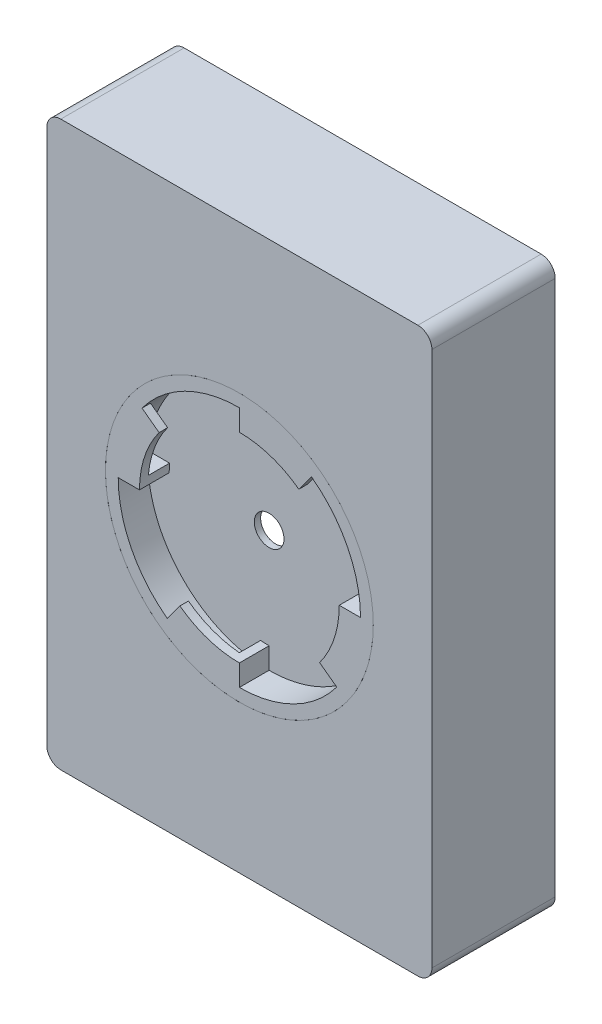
ISO-10303-21;
HEADER;
FILE_DESCRIPTION(('STEP AP214'),'2;1');
FILE_NAME('part.step','',(''),(''),'','','');
FILE_SCHEMA(('AUTOMOTIVE_DESIGN { 1 0 10303 214 1 1 1 1 }'));
ENDSEC;
DATA;
#1=APPLICATION_CONTEXT('core data for automotive mechanical design processes');
#2=APPLICATION_PROTOCOL_DEFINITION('international standard','automotive_design',2000,#1);
#3=PRODUCT_CONTEXT('',#1,'mechanical');
#4=PRODUCT('Part','Part','',(#3));
#5=PRODUCT_RELATED_PRODUCT_CATEGORY('part','',(#4));
#6=PRODUCT_DEFINITION_FORMATION('','',#4);
#7=PRODUCT_DEFINITION_CONTEXT('part definition',#1,'design');
#8=PRODUCT_DEFINITION('design','',#6,#7);
#9=PRODUCT_DEFINITION_SHAPE('','',#8);
#10=(LENGTH_UNIT() NAMED_UNIT(*) SI_UNIT(.MILLI.,.METRE.));
#11=(NAMED_UNIT(*) PLANE_ANGLE_UNIT() SI_UNIT($,.RADIAN.));
#12=(NAMED_UNIT(*) SI_UNIT($,.STERADIAN.) SOLID_ANGLE_UNIT());
#13=UNCERTAINTY_MEASURE_WITH_UNIT(LENGTH_MEASURE(1.E-05),#10,'distance_accuracy_value','');
#14=(GEOMETRIC_REPRESENTATION_CONTEXT(3) GLOBAL_UNCERTAINTY_ASSIGNED_CONTEXT((#13)) GLOBAL_UNIT_ASSIGNED_CONTEXT((#10,
#11,#12)) REPRESENTATION_CONTEXT('',''));
#15=CARTESIAN_POINT('',(0.,0.,0.));
#16=DIRECTION('',(0.,0.,1.));
#17=DIRECTION('',(1.,0.,0.));
#18=AXIS2_PLACEMENT_3D('',#15,#16,#17);
#19=CARTESIAN_POINT('',(-21.7208006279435,6.22045454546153,998.200000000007));
#20=DIRECTION('',(0.,0.,1.));
#21=DIRECTION('',(1.,0.,0.));
#22=AXIS2_PLACEMENT_3D('',#19,#20,#21);
#23=CYLINDRICAL_SURFACE('',#22,5.);
#24=CARTESIAN_POINT('',(-21.7208006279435,6.22045454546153,998.200000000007));
#25=DIRECTION('',(0.,0.,-1.));
#26=DIRECTION('',(-1.,0.,0.));
#27=AXIS2_PLACEMENT_3D('',#24,#25,#26);
#28=CIRCLE('',#27,5.);
#29=CARTESIAN_POINT('',(-26.7208006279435,6.22045454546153,998.200000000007));
#30=VERTEX_POINT('',#29);
#31=EDGE_CURVE('P0_E189',#30,#30,#28,.T.);
#32=ORIENTED_EDGE('',*,*,#31,.F.);
#33=EDGE_LOOP('',(#32));
#34=FACE_BOUND('',#33,.T.);
#35=DIRECTION('',(0.,0.,1.));
#36=VECTOR('',#35,1.);
#37=CARTESIAN_POINT('',(-24.7857623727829,2.27001032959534,1006.00000000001));
#38=LINE('',#37,#36);
#39=CARTESIAN_POINT('',(-24.7857623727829,2.27001032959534,1006.00000000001));
#40=VERTEX_POINT('',#39);
#41=CARTESIAN_POINT('',(-24.7857623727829,2.27001032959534,1013.20000000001));
#42=VERTEX_POINT('',#41);
#43=EDGE_CURVE('P0_E145',#40,#42,#38,.T.);
#44=ORIENTED_EDGE('',*,*,#43,.F.);
#45=CARTESIAN_POINT('',(-21.7208006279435,6.22045454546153,1006.00000000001));
#46=DIRECTION('',(0.,0.,1.));
#47=DIRECTION('',(1.,0.,0.));
#48=AXIS2_PLACEMENT_3D('',#45,#46,#47);
#49=CIRCLE('',#48,5.);
#50=CARTESIAN_POINT('',(-22.4214033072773,11.1711268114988,1006.00000000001));
#51=VERTEX_POINT('',#50);
#52=EDGE_CURVE('P0_E149',#51,#40,#49,.T.);
#53=ORIENTED_EDGE('',*,*,#52,.F.);
#54=DIRECTION('',(0.,0.,1.));
#55=VECTOR('',#54,1.);
#56=CARTESIAN_POINT('',(-22.4214033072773,11.1711268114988,1006.00000000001));
#57=LINE('',#56,#55);
#58=CARTESIAN_POINT('',(-22.4214033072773,11.1711268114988,1013.20000000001));
#59=VERTEX_POINT('',#58);
#60=EDGE_CURVE('P0_E147',#51,#59,#57,.T.);
#61=ORIENTED_EDGE('',*,*,#60,.T.);
#62=CARTESIAN_POINT('',(-21.7208006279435,6.22045454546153,1013.20000000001));
#63=DIRECTION('',(0.,0.,-1.));
#64=DIRECTION('',(-1.,0.,0.));
#65=AXIS2_PLACEMENT_3D('',#62,#63,#64);
#66=CIRCLE('',#65,5.);
#67=EDGE_CURVE('P0_E156',#59,#42,#66,.T.);
#68=ORIENTED_EDGE('',*,*,#67,.T.);
#69=EDGE_LOOP('',(#44,#53,#61,#68));
#70=FACE_BOUND('',#69,.T.);
#71=ADVANCED_FACE('P0_F17',(#34,#70),#23,.T.);
#72=CARTESIAN_POINT('',(-53.7208006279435,14.7204545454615,1014.50000000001));
#73=DIRECTION('',(0.,0.,1.));
#74=DIRECTION('',(1.,0.,0.));
#75=AXIS2_PLACEMENT_3D('',#72,#73,#74);
#76=PLANE('',#75);
#77=CARTESIAN_POINT('',(-53.7208006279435,14.7204545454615,1014.50000000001));
#78=DIRECTION('',(0.,0.,1.));
#79=DIRECTION('',(1.,0.,0.));
#80=AXIS2_PLACEMENT_3D('',#77,#78,#79);
#81=CIRCLE('',#80,31.5);
#82=CARTESIAN_POINT('',(-22.2208006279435,14.7204545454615,1014.50000000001));
#83=VERTEX_POINT('',#82);
#84=EDGE_CURVE('P0_E209',#83,#83,#81,.T.);
#85=ORIENTED_EDGE('',*,*,#84,.F.);
#86=EDGE_LOOP('',(#85));
#87=FACE_BOUND('',#86,.T.);
#88=DIRECTION('',(-1.,0.,0.));
#89=VECTOR('',#88,1.);
#90=CARTESIAN_POINT('',(-99.0208006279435,81.0204545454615,1014.50000000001));
#91=LINE('',#90,#89);
#92=CARTESIAN_POINT('',(-11.7208006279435,81.0204545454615,1014.50000000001));
#93=VERTEX_POINT('',#92);
#94=CARTESIAN_POINT('',(-95.7208006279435,81.0204545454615,1014.50000000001));
#95=VERTEX_POINT('',#94);
#96=EDGE_CURVE('P0_E224',#93,#95,#91,.T.);
#97=ORIENTED_EDGE('',*,*,#96,.T.);
#98=CARTESIAN_POINT('',(-95.7208006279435,77.7204545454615,1014.50000000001));
#99=DIRECTION('',(0.,0.,1.));
#100=DIRECTION('',(1.,0.,0.));
#101=AXIS2_PLACEMENT_3D('',#98,#99,#100);
#102=CIRCLE('',#101,3.3);
#103=CARTESIAN_POINT('',(-99.0208006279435,77.7204545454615,1014.50000000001));
#104=VERTEX_POINT('',#103);
#105=EDGE_CURVE('P0_E317',#95,#104,#102,.T.);
#106=ORIENTED_EDGE('',*,*,#105,.T.);
#107=DIRECTION('',(0.,-1.,0.));
#108=VECTOR('',#107,1.);
#109=CARTESIAN_POINT('',(-99.0208006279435,81.0204545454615,1014.50000000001));
#110=LINE('',#109,#108);
#111=CARTESIAN_POINT('',(-99.0208006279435,-48.2795454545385,1014.50000000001));
#112=VERTEX_POINT('',#111);
#113=EDGE_CURVE('P0_E240',#104,#112,#110,.T.);
#114=ORIENTED_EDGE('',*,*,#113,.T.);
#115=CARTESIAN_POINT('',(-95.7208006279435,-48.2795454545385,1014.50000000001));
#116=DIRECTION('',(0.,0.,1.));
#117=DIRECTION('',(1.,0.,0.));
#118=AXIS2_PLACEMENT_3D('',#115,#116,#117);
#119=CIRCLE('',#118,3.3);
#120=CARTESIAN_POINT('',(-95.7208006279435,-51.5795454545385,1014.50000000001));
#121=VERTEX_POINT('',#120);
#122=EDGE_CURVE('P0_E315',#112,#121,#119,.T.);
#123=ORIENTED_EDGE('',*,*,#122,.T.);
#124=DIRECTION('',(1.,0.,0.));
#125=VECTOR('',#124,1.);
#126=CARTESIAN_POINT('',(-99.0208006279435,-51.5795454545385,1014.50000000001));
#127=LINE('',#126,#125);
#128=CARTESIAN_POINT('',(-11.7208006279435,-51.5795454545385,1014.50000000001));
#129=VERTEX_POINT('',#128);
#130=EDGE_CURVE('P0_E243',#121,#129,#127,.T.);
#131=ORIENTED_EDGE('',*,*,#130,.T.);
#132=CARTESIAN_POINT('',(-11.7208006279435,-48.2795454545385,1014.50000000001));
#133=DIRECTION('',(0.,0.,1.));
#134=DIRECTION('',(1.,0.,0.));
#135=AXIS2_PLACEMENT_3D('',#132,#133,#134);
#136=CIRCLE('',#135,3.3);
#137=CARTESIAN_POINT('',(-8.42080062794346,-48.2795454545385,1014.50000000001));
#138=VERTEX_POINT('',#137);
#139=EDGE_CURVE('P0_E313',#129,#138,#136,.T.);
#140=ORIENTED_EDGE('',*,*,#139,.T.);
#141=DIRECTION('',(0.,1.,0.));
#142=VECTOR('',#141,1.);
#143=CARTESIAN_POINT('',(-8.42080062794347,81.0204545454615,1014.50000000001));
#144=LINE('',#143,#142);
#145=CARTESIAN_POINT('',(-8.42080062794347,77.7204545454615,1014.50000000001));
#146=VERTEX_POINT('',#145);
#147=EDGE_CURVE('P0_E229',#138,#146,#144,.T.);
#148=ORIENTED_EDGE('',*,*,#147,.T.);
#149=CARTESIAN_POINT('',(-11.7208006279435,77.7204545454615,1014.50000000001));
#150=DIRECTION('',(0.,0.,1.));
#151=DIRECTION('',(1.,0.,0.));
#152=AXIS2_PLACEMENT_3D('',#149,#150,#151);
#153=CIRCLE('',#152,3.3);
#154=EDGE_CURVE('P0_E311',#146,#93,#153,.T.);
#155=ORIENTED_EDGE('',*,*,#154,.T.);
#156=EDGE_LOOP('',(#97,#106,#114,#123,#131,#140,#148,#155));
#157=FACE_BOUND('',#156,.T.);
#158=ADVANCED_FACE('P0_F344',(#87,#157),#76,.T.);
#159=CARTESIAN_POINT('',(-97.7208006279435,79.7204545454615,985.500000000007));
#160=DIRECTION('',(-1.,0.,0.));
#161=DIRECTION('',(0.,0.,1.));
#162=AXIS2_PLACEMENT_3D('',#159,#160,#161);
#163=PLANE('',#162);
#164=DIRECTION('',(0.,-1.,0.));
#165=VECTOR('',#164,1.);
#166=CARTESIAN_POINT('',(-97.7208006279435,79.7204545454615,985.500000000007));
#167=LINE('',#166,#165);
#168=CARTESIAN_POINT('',(-97.7208006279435,77.7204545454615,985.500000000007));
#169=VERTEX_POINT('',#168);
#170=CARTESIAN_POINT('',(-97.7208006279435,-48.2795454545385,985.500000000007));
#171=VERTEX_POINT('',#170);
#172=EDGE_CURVE('P0_E212',#169,#171,#167,.T.);
#173=ORIENTED_EDGE('',*,*,#172,.F.);
#174=DIRECTION('',(0.,0.,1.));
#175=VECTOR('',#174,1.);
#176=CARTESIAN_POINT('',(-97.7208006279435,77.7204545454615,1013.20000000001));
#177=LINE('',#176,#175);
#178=CARTESIAN_POINT('',(-97.7208006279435,77.7204545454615,1013.20000000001));
#179=VERTEX_POINT('',#178);
#180=EDGE_CURVE('P0_E272',#169,#179,#177,.T.);
#181=ORIENTED_EDGE('',*,*,#180,.T.);
#182=DIRECTION('',(0.,-1.,0.));
#183=VECTOR('',#182,1.);
#184=CARTESIAN_POINT('',(-97.7208006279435,14.7204545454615,1013.20000000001));
#185=LINE('',#184,#183);
#186=CARTESIAN_POINT('',(-97.7208006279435,-48.2795454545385,1013.20000000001));
#187=VERTEX_POINT('',#186);
#188=EDGE_CURVE('P0_E253',#179,#187,#185,.T.);
#189=ORIENTED_EDGE('',*,*,#188,.T.);
#190=DIRECTION('',(0.,0.,1.));
#191=VECTOR('',#190,1.);
#192=CARTESIAN_POINT('',(-97.7208006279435,-48.2795454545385,985.500000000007));
#193=LINE('',#192,#191);
#194=EDGE_CURVE('P0_E166',#187,#171,#193,.F.);
#195=ORIENTED_EDGE('',*,*,#194,.T.);
#196=EDGE_LOOP('',(#173,#181,#189,#195));
#197=FACE_BOUND('',#196,.T.);
#198=ADVANCED_FACE('P0_F384',(#197),#163,.F.);
#199=CARTESIAN_POINT('',(-97.7208006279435,79.7204545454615,985.500000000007));
#200=DIRECTION('',(0.,1.,0.));
#201=DIRECTION('',(0.,0.,1.));
#202=AXIS2_PLACEMENT_3D('',#199,#200,#201);
#203=PLANE('',#202);
#204=DIRECTION('',(1.,0.,0.));
#205=VECTOR('',#204,1.);
#206=CARTESIAN_POINT('',(-53.7208006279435,79.7204545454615,1013.20000000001));
#207=LINE('',#206,#205);
#208=CARTESIAN_POINT('',(-95.7208006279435,79.7204545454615,1013.20000000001));
#209=VERTEX_POINT('',#208);
#210=CARTESIAN_POINT('',(-11.7208006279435,79.7204545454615,1013.20000000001));
#211=VERTEX_POINT('',#210);
#212=EDGE_CURVE('P0_E250',#209,#211,#207,.T.);
#213=ORIENTED_EDGE('',*,*,#212,.F.);
#214=DIRECTION('',(0.,0.,1.));
#215=VECTOR('',#214,1.);
#216=CARTESIAN_POINT('',(-95.7208006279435,79.7204545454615,985.500000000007));
#217=LINE('',#216,#215);
#218=CARTESIAN_POINT('',(-95.7208006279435,79.7204545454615,985.500000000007));
#219=VERTEX_POINT('',#218);
#220=EDGE_CURVE('P0_E286',#209,#219,#217,.F.);
#221=ORIENTED_EDGE('',*,*,#220,.T.);
#222=DIRECTION('',(-1.,0.,0.));
#223=VECTOR('',#222,1.);
#224=CARTESIAN_POINT('',(-97.7208006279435,79.7204545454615,985.500000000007));
#225=LINE('',#224,#223);
#226=CARTESIAN_POINT('',(-11.7208006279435,79.7204545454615,985.500000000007));
#227=VERTEX_POINT('',#226);
#228=EDGE_CURVE('P0_E221',#227,#219,#225,.T.);
#229=ORIENTED_EDGE('',*,*,#228,.F.);
#230=DIRECTION('',(0.,0.,1.));
#231=VECTOR('',#230,1.);
#232=CARTESIAN_POINT('',(-11.7208006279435,79.7204545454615,1013.20000000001));
#233=LINE('',#232,#231);
#234=EDGE_CURVE('P0_E283',#227,#211,#233,.T.);
#235=ORIENTED_EDGE('',*,*,#234,.T.);
#236=EDGE_LOOP('',(#213,#221,#229,#235));
#237=FACE_BOUND('',#236,.T.);
#238=ADVANCED_FACE('P0_F431',(#237),#203,.F.);
#239=CARTESIAN_POINT('',(-9.72080062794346,79.7204545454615,985.500000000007));
#240=DIRECTION('',(1.,0.,0.));
#241=DIRECTION('',(0.,0.,-1.));
#242=AXIS2_PLACEMENT_3D('',#239,#240,#241);
#243=PLANE('',#242);
#244=DIRECTION('',(0.,1.,0.));
#245=VECTOR('',#244,1.);
#246=CARTESIAN_POINT('',(-9.72080062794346,79.7204545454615,985.500000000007));
#247=LINE('',#246,#245);
#248=CARTESIAN_POINT('',(-9.72080062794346,-48.2795454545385,985.500000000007));
#249=VERTEX_POINT('',#248);
#250=CARTESIAN_POINT('',(-9.72080062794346,77.7204545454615,985.500000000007));
#251=VERTEX_POINT('',#250);
#252=EDGE_CURVE('P0_E218',#249,#251,#247,.T.);
#253=ORIENTED_EDGE('',*,*,#252,.F.);
#254=DIRECTION('',(0.,0.,1.));
#255=VECTOR('',#254,1.);
#256=CARTESIAN_POINT('',(-9.72080062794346,-48.2795454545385,1013.20000000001));
#257=LINE('',#256,#255);
#258=CARTESIAN_POINT('',(-9.72080062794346,-48.2795454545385,1013.20000000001));
#259=VERTEX_POINT('',#258);
#260=EDGE_CURVE('P0_E295',#249,#259,#257,.T.);
#261=ORIENTED_EDGE('',*,*,#260,.T.);
#262=DIRECTION('',(0.,-1.,0.));
#263=VECTOR('',#262,1.);
#264=CARTESIAN_POINT('',(-9.72080062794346,14.7204545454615,1013.20000000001));
#265=LINE('',#264,#263);
#266=CARTESIAN_POINT('',(-9.72080062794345,77.7204545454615,1013.20000000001));
#267=VERTEX_POINT('',#266);
#268=EDGE_CURVE('P0_E237',#267,#259,#265,.T.);
#269=ORIENTED_EDGE('',*,*,#268,.F.);
#270=DIRECTION('',(0.,0.,1.));
#271=VECTOR('',#270,1.);
#272=CARTESIAN_POINT('',(-9.72080062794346,77.7204545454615,985.500000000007));
#273=LINE('',#272,#271);
#274=EDGE_CURVE('P0_E293',#267,#251,#273,.F.);
#275=ORIENTED_EDGE('',*,*,#274,.T.);
#276=EDGE_LOOP('',(#253,#261,#269,#275));
#277=FACE_BOUND('',#276,.T.);
#278=ADVANCED_FACE('P0_F434',(#277),#243,.F.);
#279=CARTESIAN_POINT('',(-97.7208006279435,-50.2795454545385,985.500000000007));
#280=DIRECTION('',(0.,-1.,0.));
#281=DIRECTION('',(0.,0.,-1.));
#282=AXIS2_PLACEMENT_3D('',#279,#280,#281);
#283=PLANE('',#282);
#284=DIRECTION('',(1.,0.,0.));
#285=VECTOR('',#284,1.);
#286=CARTESIAN_POINT('',(-97.7208006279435,-50.2795454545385,985.500000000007));
#287=LINE('',#286,#285);
#288=CARTESIAN_POINT('',(-95.7208006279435,-50.2795454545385,985.500000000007));
#289=VERTEX_POINT('',#288);
#290=CARTESIAN_POINT('',(-11.7208006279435,-50.2795454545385,985.500000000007));
#291=VERTEX_POINT('',#290);
#292=EDGE_CURVE('P0_E215',#289,#291,#287,.T.);
#293=ORIENTED_EDGE('',*,*,#292,.F.);
#294=DIRECTION('',(0.,0.,1.));
#295=VECTOR('',#294,1.);
#296=CARTESIAN_POINT('',(-95.7208006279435,-50.2795454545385,1013.20000000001));
#297=LINE('',#296,#295);
#298=CARTESIAN_POINT('',(-95.7208006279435,-50.2795454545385,1013.20000000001));
#299=VERTEX_POINT('',#298);
#300=EDGE_CURVE('P0_E290',#289,#299,#297,.T.);
#301=ORIENTED_EDGE('',*,*,#300,.T.);
#302=DIRECTION('',(1.,0.,0.));
#303=VECTOR('',#302,1.);
#304=CARTESIAN_POINT('',(-53.7208006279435,-50.2795454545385,1013.20000000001));
#305=LINE('',#304,#303);
#306=CARTESIAN_POINT('',(-11.7208006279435,-50.2795454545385,1013.20000000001));
#307=VERTEX_POINT('',#306);
#308=EDGE_CURVE('P0_E256',#299,#307,#305,.T.);
#309=ORIENTED_EDGE('',*,*,#308,.T.);
#310=DIRECTION('',(0.,0.,1.));
#311=VECTOR('',#310,1.);
#312=CARTESIAN_POINT('',(-11.7208006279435,-50.2795454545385,985.500000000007));
#313=LINE('',#312,#311);
#314=EDGE_CURVE('P0_E288',#307,#291,#313,.F.);
#315=ORIENTED_EDGE('',*,*,#314,.T.);
#316=EDGE_LOOP('',(#293,#301,#309,#315));
#317=FACE_BOUND('',#316,.T.);
#318=ADVANCED_FACE('P0_F438',(#317),#283,.F.);
#319=CARTESIAN_POINT('',(-99.0208006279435,81.0204545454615,985.500000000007));
#320=DIRECTION('',(0.,1.,0.));
#321=DIRECTION('',(0.,0.,1.));
#322=AXIS2_PLACEMENT_3D('',#319,#320,#321);
#323=PLANE('',#322);
#324=DIRECTION('',(-1.,0.,0.));
#325=VECTOR('',#324,1.);
#326=CARTESIAN_POINT('',(-99.0208006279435,81.0204545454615,985.500000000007));
#327=LINE('',#326,#325);
#328=CARTESIAN_POINT('',(-11.7208006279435,81.0204545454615,985.500000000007));
#329=VERTEX_POINT('',#328);
#330=CARTESIAN_POINT('',(-95.7208006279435,81.0204545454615,985.500000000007));
#331=VERTEX_POINT('',#330);
#332=EDGE_CURVE('P0_E225',#329,#331,#327,.T.);
#333=ORIENTED_EDGE('',*,*,#332,.T.);
#334=DIRECTION('',(0.,0.,1.));
#335=VECTOR('',#334,1.);
#336=CARTESIAN_POINT('',(-95.7208006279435,81.0204545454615,985.500000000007));
#337=LINE('',#336,#335);
#338=EDGE_CURVE('P0_E308',#331,#95,#337,.T.);
#339=ORIENTED_EDGE('',*,*,#338,.T.);
#340=ORIENTED_EDGE('',*,*,#96,.F.);
#341=DIRECTION('',(0.,0.,1.));
#342=VECTOR('',#341,1.);
#343=CARTESIAN_POINT('',(-11.7208006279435,81.0204545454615,985.500000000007));
#344=LINE('',#343,#342);
#345=EDGE_CURVE('P0_E306',#93,#329,#344,.F.);
#346=ORIENTED_EDGE('',*,*,#345,.T.);
#347=EDGE_LOOP('',(#333,#339,#340,#346));
#348=FACE_BOUND('',#347,.T.);
#349=ADVANCED_FACE('P0_F368',(#348),#323,.T.);
#350=CARTESIAN_POINT('',(-8.42080062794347,81.0204545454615,985.500000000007));
#351=DIRECTION('',(1.,0.,0.));
#352=DIRECTION('',(0.,1.,0.));
#353=AXIS2_PLACEMENT_3D('',#350,#351,#352);
#354=PLANE('',#353);
#355=ORIENTED_EDGE('',*,*,#147,.F.);
#356=DIRECTION('',(0.,0.,1.));
#357=VECTOR('',#356,1.);
#358=CARTESIAN_POINT('',(-8.42080062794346,-48.2795454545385,985.500000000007));
#359=LINE('',#358,#357);
#360=CARTESIAN_POINT('',(-8.42080062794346,-48.2795454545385,985.500000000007));
#361=VERTEX_POINT('',#360);
#362=EDGE_CURVE('P0_E11',#138,#361,#359,.F.);
#363=ORIENTED_EDGE('',*,*,#362,.T.);
#364=DIRECTION('',(0.,1.,0.));
#365=VECTOR('',#364,1.);
#366=CARTESIAN_POINT('',(-8.42080062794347,81.0204545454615,985.500000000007));
#367=LINE('',#366,#365);
#368=CARTESIAN_POINT('',(-8.42080062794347,77.7204545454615,985.500000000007));
#369=VERTEX_POINT('',#368);
#370=EDGE_CURVE('P0_E234',#361,#369,#367,.T.);
#371=ORIENTED_EDGE('',*,*,#370,.T.);
#372=DIRECTION('',(0.,0.,1.));
#373=VECTOR('',#372,1.);
#374=CARTESIAN_POINT('',(-8.42080062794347,77.7204545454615,985.500000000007));
#375=LINE('',#374,#373);
#376=EDGE_CURVE('P0_E25',#369,#146,#375,.T.);
#377=ORIENTED_EDGE('',*,*,#376,.T.);
#378=EDGE_LOOP('',(#355,#363,#371,#377));
#379=FACE_BOUND('',#378,.T.);
#380=ADVANCED_FACE('P0_F339',(#379),#354,.T.);
#381=CARTESIAN_POINT('',(-99.0208006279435,-51.5795454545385,985.500000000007));
#382=DIRECTION('',(0.,-1.,0.));
#383=DIRECTION('',(0.,0.,-1.));
#384=AXIS2_PLACEMENT_3D('',#381,#382,#383);
#385=PLANE('',#384);
#386=ORIENTED_EDGE('',*,*,#130,.F.);
#387=DIRECTION('',(0.,0.,1.));
#388=VECTOR('',#387,1.);
#389=CARTESIAN_POINT('',(-95.7208006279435,-51.5795454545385,985.500000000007));
#390=LINE('',#389,#388);
#391=CARTESIAN_POINT('',(-95.7208006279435,-51.5795454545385,985.500000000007));
#392=VERTEX_POINT('',#391);
#393=EDGE_CURVE('P0_E334',#121,#392,#390,.F.);
#394=ORIENTED_EDGE('',*,*,#393,.T.);
#395=DIRECTION('',(1.,0.,0.));
#396=VECTOR('',#395,1.);
#397=CARTESIAN_POINT('',(-99.0208006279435,-51.5795454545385,985.500000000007));
#398=LINE('',#397,#396);
#399=CARTESIAN_POINT('',(-11.7208006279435,-51.5795454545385,985.500000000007));
#400=VERTEX_POINT('',#399);
#401=EDGE_CURVE('P0_E232',#392,#400,#398,.T.);
#402=ORIENTED_EDGE('',*,*,#401,.T.);
#403=DIRECTION('',(0.,0.,1.));
#404=VECTOR('',#403,1.);
#405=CARTESIAN_POINT('',(-11.7208006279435,-51.5795454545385,985.500000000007));
#406=LINE('',#405,#404);
#407=EDGE_CURVE('P0_E331',#400,#129,#406,.T.);
#408=ORIENTED_EDGE('',*,*,#407,.T.);
#409=EDGE_LOOP('',(#386,#394,#402,#408));
#410=FACE_BOUND('',#409,.T.);
#411=ADVANCED_FACE('P0_F351',(#410),#385,.T.);
#412=CARTESIAN_POINT('',(-99.0208006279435,81.0204545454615,985.500000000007));
#413=DIRECTION('',(-1.,0.,0.));
#414=DIRECTION('',(0.,0.,1.));
#415=AXIS2_PLACEMENT_3D('',#412,#413,#414);
#416=PLANE('',#415);
#417=ORIENTED_EDGE('',*,*,#113,.F.);
#418=DIRECTION('',(0.,0.,1.));
#419=VECTOR('',#418,1.);
#420=CARTESIAN_POINT('',(-99.0208006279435,77.7204545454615,985.500000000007));
#421=LINE('',#420,#419);
#422=CARTESIAN_POINT('',(-99.0208006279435,77.7204545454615,985.500000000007));
#423=VERTEX_POINT('',#422);
#424=EDGE_CURVE('P0_E322',#104,#423,#421,.F.);
#425=ORIENTED_EDGE('',*,*,#424,.T.);
#426=DIRECTION('',(0.,-1.,0.));
#427=VECTOR('',#426,1.);
#428=CARTESIAN_POINT('',(-99.0208006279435,81.0204545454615,985.500000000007));
#429=LINE('',#428,#427);
#430=CARTESIAN_POINT('',(-99.0208006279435,-48.2795454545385,985.500000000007));
#431=VERTEX_POINT('',#430);
#432=EDGE_CURVE('P0_E228',#423,#431,#429,.T.);
#433=ORIENTED_EDGE('',*,*,#432,.T.);
#434=DIRECTION('',(0.,0.,1.));
#435=VECTOR('',#434,1.);
#436=CARTESIAN_POINT('',(-99.0208006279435,-48.2795454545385,985.500000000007));
#437=LINE('',#436,#435);
#438=EDGE_CURVE('P0_E319',#431,#112,#437,.T.);
#439=ORIENTED_EDGE('',*,*,#438,.T.);
#440=EDGE_LOOP('',(#417,#425,#433,#439));
#441=FACE_BOUND('',#440,.T.);
#442=ADVANCED_FACE('P0_F361',(#441),#416,.T.);
#443=CARTESIAN_POINT('',(-53.7208006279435,14.7204545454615,985.500000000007));
#444=DIRECTION('',(0.,0.,-1.));
#445=DIRECTION('',(-1.,0.,0.));
#446=AXIS2_PLACEMENT_3D('',#443,#444,#445);
#447=PLANE('',#446);
#448=ORIENTED_EDGE('',*,*,#228,.T.);
#449=CARTESIAN_POINT('',(-95.7208006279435,77.7204545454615,985.500000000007));
#450=DIRECTION('',(0.,0.,-1.));
#451=DIRECTION('',(-1.,0.,0.));
#452=AXIS2_PLACEMENT_3D('',#449,#450,#451);
#453=CIRCLE('',#452,2.);
#454=EDGE_CURVE('P0_E298',#219,#169,#453,.F.);
#455=ORIENTED_EDGE('',*,*,#454,.T.);
#456=ORIENTED_EDGE('',*,*,#172,.T.);
#457=CARTESIAN_POINT('',(-95.7208006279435,-48.2795454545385,985.500000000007));
#458=DIRECTION('',(0.,0.,-1.));
#459=DIRECTION('',(-1.,0.,0.));
#460=AXIS2_PLACEMENT_3D('',#457,#458,#459);
#461=CIRCLE('',#460,2.);
#462=EDGE_CURVE('P0_E300',#171,#289,#461,.F.);
#463=ORIENTED_EDGE('',*,*,#462,.T.);
#464=ORIENTED_EDGE('',*,*,#292,.T.);
#465=CARTESIAN_POINT('',(-11.7208006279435,-48.2795454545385,985.500000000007));
#466=DIRECTION('',(0.,0.,-1.));
#467=DIRECTION('',(-1.,0.,0.));
#468=AXIS2_PLACEMENT_3D('',#465,#466,#467);
#469=CIRCLE('',#468,2.);
#470=EDGE_CURVE('P0_E302',#291,#249,#469,.F.);
#471=ORIENTED_EDGE('',*,*,#470,.T.);
#472=ORIENTED_EDGE('',*,*,#252,.T.);
#473=CARTESIAN_POINT('',(-11.7208006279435,77.7204545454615,985.500000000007));
#474=DIRECTION('',(0.,0.,-1.));
#475=DIRECTION('',(-1.,0.,0.));
#476=AXIS2_PLACEMENT_3D('',#473,#474,#475);
#477=CIRCLE('',#476,2.);
#478=EDGE_CURVE('P0_E304',#251,#227,#477,.F.);
#479=ORIENTED_EDGE('',*,*,#478,.T.);
#480=EDGE_LOOP('',(#448,#455,#456,#463,#464,#471,#472,#479));
#481=FACE_BOUND('',#480,.T.);
#482=ORIENTED_EDGE('',*,*,#432,.F.);
#483=CARTESIAN_POINT('',(-95.7208006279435,77.7204545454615,985.500000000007));
#484=DIRECTION('',(0.,0.,-1.));
#485=DIRECTION('',(-1.,0.,0.));
#486=AXIS2_PLACEMENT_3D('',#483,#484,#485);
#487=CIRCLE('',#486,3.3);
#488=EDGE_CURVE('P0_E329',#423,#331,#487,.T.);
#489=ORIENTED_EDGE('',*,*,#488,.T.);
#490=ORIENTED_EDGE('',*,*,#332,.F.);
#491=CARTESIAN_POINT('',(-11.7208006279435,77.7204545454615,985.500000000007));
#492=DIRECTION('',(0.,0.,-1.));
#493=DIRECTION('',(-1.,0.,0.));
#494=AXIS2_PLACEMENT_3D('',#491,#492,#493);
#495=CIRCLE('',#494,3.3);
#496=EDGE_CURVE('P0_E324',#329,#369,#495,.T.);
#497=ORIENTED_EDGE('',*,*,#496,.T.);
#498=ORIENTED_EDGE('',*,*,#370,.F.);
#499=CARTESIAN_POINT('',(-11.7208006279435,-48.2795454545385,985.500000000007));
#500=DIRECTION('',(0.,0.,-1.));
#501=DIRECTION('',(-1.,0.,0.));
#502=AXIS2_PLACEMENT_3D('',#499,#500,#501);
#503=CIRCLE('',#502,3.3);
#504=EDGE_CURVE('P0_E39',#361,#400,#503,.T.);
#505=ORIENTED_EDGE('',*,*,#504,.T.);
#506=ORIENTED_EDGE('',*,*,#401,.F.);
#507=CARTESIAN_POINT('',(-95.7208006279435,-48.2795454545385,985.500000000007));
#508=DIRECTION('',(0.,0.,-1.));
#509=DIRECTION('',(-1.,0.,0.));
#510=AXIS2_PLACEMENT_3D('',#507,#508,#509);
#511=CIRCLE('',#510,3.3);
#512=EDGE_CURVE('P0_E327',#392,#431,#511,.T.);
#513=ORIENTED_EDGE('',*,*,#512,.T.);
#514=EDGE_LOOP('',(#482,#489,#490,#497,#498,#505,#506,#513));
#515=FACE_BOUND('',#514,.T.);
#516=ADVANCED_FACE('P0_F355',(#481,#515),#447,.T.);
#517=CARTESIAN_POINT('',(-53.7208006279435,14.7204545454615,1013.20000000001));
#518=DIRECTION('',(0.,0.,1.));
#519=DIRECTION('',(1.,0.,0.));
#520=AXIS2_PLACEMENT_3D('',#517,#518,#519);
#521=PLANE('',#520);
#522=ORIENTED_EDGE('',*,*,#67,.F.);
#523=CARTESIAN_POINT('',(-53.7208006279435,14.7204545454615,1013.20000000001));
#524=DIRECTION('',(0.,0.,1.));
#525=DIRECTION('',(1.,0.,0.));
#526=AXIS2_PLACEMENT_3D('',#523,#524,#525);
#527=CIRCLE('',#526,31.5);
#528=EDGE_CURVE('P0_E208',#59,#42,#527,.T.);
#529=ORIENTED_EDGE('',*,*,#528,.T.);
#530=EDGE_LOOP('',(#522,#529));
#531=FACE_BOUND('',#530,.T.);
#532=CARTESIAN_POINT('',(-22.7208006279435,66.7204545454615,1013.20000000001));
#533=DIRECTION('',(0.,0.,1.));
#534=DIRECTION('',(1.,0.,0.));
#535=AXIS2_PLACEMENT_3D('',#532,#533,#534);
#536=CIRCLE('',#535,5.);
#537=CARTESIAN_POINT('',(-17.7208006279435,66.7204545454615,1013.20000000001));
#538=VERTEX_POINT('',#537);
#539=EDGE_CURVE('P0_E192',#538,#538,#536,.F.);
#540=ORIENTED_EDGE('',*,*,#539,.F.);
#541=EDGE_LOOP('',(#540));
#542=FACE_BOUND('',#541,.T.);
#543=CARTESIAN_POINT('',(-87.2208006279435,69.7204545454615,1013.20000000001));
#544=DIRECTION('',(0.,0.,1.));
#545=DIRECTION('',(1.,0.,0.));
#546=AXIS2_PLACEMENT_3D('',#543,#544,#545);
#547=CIRCLE('',#546,5.);
#548=CARTESIAN_POINT('',(-82.2208006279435,69.7204545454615,1013.20000000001));
#549=VERTEX_POINT('',#548);
#550=EDGE_CURVE('P0_E266',#549,#549,#547,.F.);
#551=ORIENTED_EDGE('',*,*,#550,.F.);
#552=EDGE_LOOP('',(#551));
#553=FACE_BOUND('',#552,.T.);
#554=CARTESIAN_POINT('',(-86.7208006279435,-36.2795454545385,1013.20000000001));
#555=DIRECTION('',(0.,0.,1.));
#556=DIRECTION('',(1.,0.,0.));
#557=AXIS2_PLACEMENT_3D('',#554,#555,#556);
#558=CIRCLE('',#557,5.);
#559=CARTESIAN_POINT('',(-81.7208006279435,-36.2795454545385,1013.20000000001));
#560=VERTEX_POINT('',#559);
#561=EDGE_CURVE('P0_E263',#560,#560,#558,.F.);
#562=ORIENTED_EDGE('',*,*,#561,.F.);
#563=EDGE_LOOP('',(#562));
#564=FACE_BOUND('',#563,.T.);
#565=CARTESIAN_POINT('',(-20.7208006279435,-39.7795454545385,1013.20000000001));
#566=DIRECTION('',(0.,0.,1.));
#567=DIRECTION('',(1.,0.,0.));
#568=AXIS2_PLACEMENT_3D('',#565,#566,#567);
#569=CIRCLE('',#568,5.);
#570=CARTESIAN_POINT('',(-15.7208006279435,-39.7795454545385,1013.20000000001));
#571=VERTEX_POINT('',#570);
#572=EDGE_CURVE('P0_E259',#571,#571,#569,.F.);
#573=ORIENTED_EDGE('',*,*,#572,.F.);
#574=EDGE_LOOP('',(#573));
#575=FACE_BOUND('',#574,.T.);
#576=ORIENTED_EDGE('',*,*,#188,.F.);
#577=CARTESIAN_POINT('',(-95.7208006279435,77.7204545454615,1013.20000000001));
#578=DIRECTION('',(0.,0.,1.));
#579=DIRECTION('',(1.,0.,0.));
#580=AXIS2_PLACEMENT_3D('',#577,#578,#579);
#581=CIRCLE('',#580,2.);
#582=EDGE_CURVE('P0_E281',#179,#209,#581,.F.);
#583=ORIENTED_EDGE('',*,*,#582,.T.);
#584=ORIENTED_EDGE('',*,*,#212,.T.);
#585=CARTESIAN_POINT('',(-11.7208006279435,77.7204545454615,1013.20000000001));
#586=DIRECTION('',(0.,0.,1.));
#587=DIRECTION('',(1.,0.,0.));
#588=AXIS2_PLACEMENT_3D('',#585,#586,#587);
#589=CIRCLE('',#588,2.);
#590=EDGE_CURVE('P0_E275',#211,#267,#589,.F.);
#591=ORIENTED_EDGE('',*,*,#590,.T.);
#592=ORIENTED_EDGE('',*,*,#268,.T.);
#593=CARTESIAN_POINT('',(-11.7208006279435,-48.2795454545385,1013.20000000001));
#594=DIRECTION('',(0.,0.,1.));
#595=DIRECTION('',(1.,0.,0.));
#596=AXIS2_PLACEMENT_3D('',#593,#594,#595);
#597=CIRCLE('',#596,2.);
#598=EDGE_CURVE('P0_E277',#259,#307,#597,.F.);
#599=ORIENTED_EDGE('',*,*,#598,.T.);
#600=ORIENTED_EDGE('',*,*,#308,.F.);
#601=CARTESIAN_POINT('',(-95.7208006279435,-48.2795454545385,1013.20000000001));
#602=DIRECTION('',(0.,0.,1.));
#603=DIRECTION('',(1.,0.,0.));
#604=AXIS2_PLACEMENT_3D('',#601,#602,#603);
#605=CIRCLE('',#604,2.);
#606=EDGE_CURVE('P0_E279',#299,#187,#605,.F.);
#607=ORIENTED_EDGE('',*,*,#606,.T.);
#608=EDGE_LOOP('',(#576,#583,#584,#591,#592,#599,#600,#607));
#609=FACE_BOUND('',#608,.T.);
#610=ADVANCED_FACE('P0_F430',(#531,#542,#553,#564,#575,#609),#521,.F.);
#611=CARTESIAN_POINT('',(-53.7208006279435,14.7204545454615,1015.50000000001));
#612=DIRECTION('',(0.,0.,-1.));
#613=DIRECTION('',(-1.,0.,0.));
#614=AXIS2_PLACEMENT_3D('',#611,#612,#613);
#615=CYLINDRICAL_SURFACE('',#614,31.5);
#616=ORIENTED_EDGE('',*,*,#43,.T.);
#617=ORIENTED_EDGE('',*,*,#528,.F.);
#618=ORIENTED_EDGE('',*,*,#60,.F.);
#619=CARTESIAN_POINT('',(-53.7208006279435,14.7204545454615,1006.00000000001));
#620=DIRECTION('',(0.,0.,1.));
#621=DIRECTION('',(1.,0.,0.));
#622=AXIS2_PLACEMENT_3D('',#619,#620,#621);
#623=CIRCLE('',#622,31.5);
#624=EDGE_CURVE('P0_E31',#51,#40,#623,.F.);
#625=ORIENTED_EDGE('',*,*,#624,.T.);
#626=EDGE_LOOP('',(#616,#617,#618,#625));
#627=FACE_BOUND('',#626,.T.);
#628=ORIENTED_EDGE('',*,*,#84,.T.);
#629=EDGE_LOOP('',(#628));
#630=FACE_BOUND('',#629,.T.);
#631=ADVANCED_FACE('P0_F141',(#627,#630),#615,.F.);
#632=CARTESIAN_POINT('',(-20.7208006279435,-39.7795454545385,998.200000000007));
#633=DIRECTION('',(0.,0.,1.));
#634=DIRECTION('',(1.,0.,0.));
#635=AXIS2_PLACEMENT_3D('',#632,#633,#634);
#636=CYLINDRICAL_SURFACE('',#635,5.);
#637=CARTESIAN_POINT('',(-20.7208006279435,-39.7795454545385,998.200000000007));
#638=DIRECTION('',(0.,0.,-1.));
#639=DIRECTION('',(-1.,0.,0.));
#640=AXIS2_PLACEMENT_3D('',#637,#638,#639);
#641=CIRCLE('',#640,5.);
#642=CARTESIAN_POINT('',(-25.7208006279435,-39.7795454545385,998.200000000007));
#643=VERTEX_POINT('',#642);
#644=EDGE_CURVE('P0_E205',#643,#643,#641,.T.);
#645=ORIENTED_EDGE('',*,*,#644,.F.);
#646=EDGE_LOOP('',(#645));
#647=FACE_BOUND('',#646,.T.);
#648=ORIENTED_EDGE('',*,*,#572,.T.);
#649=EDGE_LOOP('',(#648));
#650=FACE_BOUND('',#649,.T.);
#651=ADVANCED_FACE('P0_F423',(#647,#650),#636,.T.);
#652=CARTESIAN_POINT('',(-20.7208006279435,-39.7795454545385,998.200000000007));
#653=DIRECTION('',(0.,0.,-1.));
#654=DIRECTION('',(-1.,0.,0.));
#655=AXIS2_PLACEMENT_3D('',#652,#653,#654);
#656=PLANE('',#655);
#657=CARTESIAN_POINT('',(-20.7208006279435,-39.7795454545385,998.200000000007));
#658=DIRECTION('',(0.,0.,-1.));
#659=DIRECTION('',(-1.,0.,0.));
#660=AXIS2_PLACEMENT_3D('',#657,#658,#659);
#661=CIRCLE('',#660,2.5);
#662=CARTESIAN_POINT('',(-23.2208006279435,-39.7795454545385,998.200000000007));
#663=VERTEX_POINT('',#662);
#664=EDGE_CURVE('P0_E183',#663,#663,#661,.T.);
#665=ORIENTED_EDGE('',*,*,#664,.F.);
#666=EDGE_LOOP('',(#665));
#667=FACE_BOUND('',#666,.T.);
#668=ORIENTED_EDGE('',*,*,#644,.T.);
#669=EDGE_LOOP('',(#668));
#670=FACE_BOUND('',#669,.T.);
#671=ADVANCED_FACE('P0_F416',(#667,#670),#656,.T.);
#672=CARTESIAN_POINT('',(-86.7208006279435,-36.2795454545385,998.200000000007));
#673=DIRECTION('',(0.,0.,1.));
#674=DIRECTION('',(1.,0.,0.));
#675=AXIS2_PLACEMENT_3D('',#672,#673,#674);
#676=CYLINDRICAL_SURFACE('',#675,5.);
#677=CARTESIAN_POINT('',(-86.7208006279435,-36.2795454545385,998.200000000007));
#678=DIRECTION('',(0.,0.,-1.));
#679=DIRECTION('',(-1.,0.,0.));
#680=AXIS2_PLACEMENT_3D('',#677,#678,#679);
#681=CIRCLE('',#680,5.);
#682=CARTESIAN_POINT('',(-91.7208006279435,-36.2795454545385,998.200000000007));
#683=VERTEX_POINT('',#682);
#684=EDGE_CURVE('P0_E202',#683,#683,#681,.T.);
#685=ORIENTED_EDGE('',*,*,#684,.F.);
#686=EDGE_LOOP('',(#685));
#687=FACE_BOUND('',#686,.T.);
#688=ORIENTED_EDGE('',*,*,#561,.T.);
#689=EDGE_LOOP('',(#688));
#690=FACE_BOUND('',#689,.T.);
#691=ADVANCED_FACE('P0_F413',(#687,#690),#676,.T.);
#692=CARTESIAN_POINT('',(-86.7208006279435,-36.2795454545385,998.200000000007));
#693=DIRECTION('',(0.,0.,-1.));
#694=DIRECTION('',(-1.,0.,0.));
#695=AXIS2_PLACEMENT_3D('',#692,#693,#694);
#696=PLANE('',#695);
#697=CARTESIAN_POINT('',(-86.7208006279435,-36.2795454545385,998.200000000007));
#698=DIRECTION('',(0.,0.,-1.));
#699=DIRECTION('',(-1.,0.,0.));
#700=AXIS2_PLACEMENT_3D('',#697,#698,#699);
#701=CIRCLE('',#700,2.5);
#702=CARTESIAN_POINT('',(-89.2208006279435,-36.2795454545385,998.200000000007));
#703=VERTEX_POINT('',#702);
#704=EDGE_CURVE('P0_E177',#703,#703,#701,.T.);
#705=ORIENTED_EDGE('',*,*,#704,.F.);
#706=EDGE_LOOP('',(#705));
#707=FACE_BOUND('',#706,.T.);
#708=ORIENTED_EDGE('',*,*,#684,.T.);
#709=EDGE_LOOP('',(#708));
#710=FACE_BOUND('',#709,.T.);
#711=ADVANCED_FACE('P0_F408',(#707,#710),#696,.T.);
#712=CARTESIAN_POINT('',(-87.2208006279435,69.7204545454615,998.200000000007));
#713=DIRECTION('',(0.,0.,1.));
#714=DIRECTION('',(1.,0.,0.));
#715=AXIS2_PLACEMENT_3D('',#712,#713,#714);
#716=CYLINDRICAL_SURFACE('',#715,5.);
#717=CARTESIAN_POINT('',(-87.2208006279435,69.7204545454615,998.200000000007));
#718=DIRECTION('',(0.,0.,-1.));
#719=DIRECTION('',(-1.,0.,0.));
#720=AXIS2_PLACEMENT_3D('',#717,#718,#719);
#721=CIRCLE('',#720,5.);
#722=CARTESIAN_POINT('',(-92.2208006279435,69.7204545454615,998.200000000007));
#723=VERTEX_POINT('',#722);
#724=EDGE_CURVE('P0_E199',#723,#723,#721,.T.);
#725=ORIENTED_EDGE('',*,*,#724,.F.);
#726=EDGE_LOOP('',(#725));
#727=FACE_BOUND('',#726,.T.);
#728=ORIENTED_EDGE('',*,*,#550,.T.);
#729=EDGE_LOOP('',(#728));
#730=FACE_BOUND('',#729,.T.);
#731=ADVANCED_FACE('P0_F405',(#727,#730),#716,.T.);
#732=CARTESIAN_POINT('',(-87.2208006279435,69.7204545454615,998.200000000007));
#733=DIRECTION('',(0.,0.,-1.));
#734=DIRECTION('',(-1.,0.,0.));
#735=AXIS2_PLACEMENT_3D('',#732,#733,#734);
#736=PLANE('',#735);
#737=CARTESIAN_POINT('',(-87.2208006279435,69.7204545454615,998.200000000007));
#738=DIRECTION('',(0.,0.,-1.));
#739=DIRECTION('',(-1.,0.,0.));
#740=AXIS2_PLACEMENT_3D('',#737,#738,#739);
#741=CIRCLE('',#740,2.5);
#742=CARTESIAN_POINT('',(-89.7208006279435,69.7204545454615,998.200000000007));
#743=VERTEX_POINT('',#742);
#744=EDGE_CURVE('P0_E164',#743,#743,#741,.T.);
#745=ORIENTED_EDGE('',*,*,#744,.F.);
#746=EDGE_LOOP('',(#745));
#747=FACE_BOUND('',#746,.T.);
#748=ORIENTED_EDGE('',*,*,#724,.T.);
#749=EDGE_LOOP('',(#748));
#750=FACE_BOUND('',#749,.T.);
#751=ADVANCED_FACE('P0_F400',(#747,#750),#736,.T.);
#752=CARTESIAN_POINT('',(-22.7208006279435,66.7204545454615,998.200000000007));
#753=DIRECTION('',(0.,0.,1.));
#754=DIRECTION('',(1.,0.,0.));
#755=AXIS2_PLACEMENT_3D('',#752,#753,#754);
#756=CYLINDRICAL_SURFACE('',#755,5.);
#757=CARTESIAN_POINT('',(-22.7208006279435,66.7204545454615,998.200000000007));
#758=DIRECTION('',(0.,0.,-1.));
#759=DIRECTION('',(-1.,0.,0.));
#760=AXIS2_PLACEMENT_3D('',#757,#758,#759);
#761=CIRCLE('',#760,5.);
#762=CARTESIAN_POINT('',(-27.7208006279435,66.7204545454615,998.200000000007));
#763=VERTEX_POINT('',#762);
#764=EDGE_CURVE('P0_E194',#763,#763,#761,.T.);
#765=ORIENTED_EDGE('',*,*,#764,.F.);
#766=EDGE_LOOP('',(#765));
#767=FACE_BOUND('',#766,.T.);
#768=ORIENTED_EDGE('',*,*,#539,.T.);
#769=EDGE_LOOP('',(#768));
#770=FACE_BOUND('',#769,.T.);
#771=ADVANCED_FACE('P0_F397',(#767,#770),#756,.T.);
#772=CARTESIAN_POINT('',(-22.7208006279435,66.7204545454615,998.200000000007));
#773=DIRECTION('',(0.,0.,-1.));
#774=DIRECTION('',(-1.,0.,0.));
#775=AXIS2_PLACEMENT_3D('',#772,#773,#774);
#776=PLANE('',#775);
#777=CARTESIAN_POINT('',(-22.7208006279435,66.7204545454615,998.200000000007));
#778=DIRECTION('',(0.,0.,-1.));
#779=DIRECTION('',(-1.,0.,0.));
#780=AXIS2_PLACEMENT_3D('',#777,#778,#779);
#781=CIRCLE('',#780,2.5);
#782=CARTESIAN_POINT('',(-25.2208006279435,66.7204545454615,998.200000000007));
#783=VERTEX_POINT('',#782);
#784=EDGE_CURVE('P0_E167',#783,#783,#781,.T.);
#785=ORIENTED_EDGE('',*,*,#784,.F.);
#786=EDGE_LOOP('',(#785));
#787=FACE_BOUND('',#786,.T.);
#788=ORIENTED_EDGE('',*,*,#764,.T.);
#789=EDGE_LOOP('',(#788));
#790=FACE_BOUND('',#789,.T.);
#791=ADVANCED_FACE('P0_F395',(#787,#790),#776,.T.);
#792=CARTESIAN_POINT('',(-21.7208006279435,6.22045454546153,998.200000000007));
#793=DIRECTION('',(0.,0.,-1.));
#794=DIRECTION('',(-1.,0.,0.));
#795=AXIS2_PLACEMENT_3D('',#792,#793,#794);
#796=PLANE('',#795);
#797=CARTESIAN_POINT('',(-21.7208006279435,6.22045454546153,998.200000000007));
#798=DIRECTION('',(0.,0.,-1.));
#799=DIRECTION('',(-1.,0.,0.));
#800=AXIS2_PLACEMENT_3D('',#797,#798,#799);
#801=CIRCLE('',#800,2.5);
#802=CARTESIAN_POINT('',(-24.2208006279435,6.22045454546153,998.200000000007));
#803=VERTEX_POINT('',#802);
#804=EDGE_CURVE('P0_E171',#803,#803,#801,.T.);
#805=ORIENTED_EDGE('',*,*,#804,.F.);
#806=EDGE_LOOP('',(#805));
#807=FACE_BOUND('',#806,.T.);
#808=ORIENTED_EDGE('',*,*,#31,.T.);
#809=EDGE_LOOP('',(#808));
#810=FACE_BOUND('',#809,.T.);
#811=ADVANCED_FACE('P0_F392',(#807,#810),#796,.T.);
#812=CARTESIAN_POINT('',(-20.7208006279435,-39.7795454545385,995.200000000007));
#813=DIRECTION('',(0.,0.,1.));
#814=DIRECTION('',(1.,0.,0.));
#815=AXIS2_PLACEMENT_3D('',#812,#813,#814);
#816=CYLINDRICAL_SURFACE('',#815,2.5);
#817=CARTESIAN_POINT('',(-20.7208006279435,-39.7795454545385,995.200000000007));
#818=DIRECTION('',(0.,0.,-1.));
#819=DIRECTION('',(-1.,0.,0.));
#820=AXIS2_PLACEMENT_3D('',#817,#818,#819);
#821=CIRCLE('',#820,2.5);
#822=CARTESIAN_POINT('',(-23.2208006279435,-39.7795454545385,995.200000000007));
#823=VERTEX_POINT('',#822);
#824=EDGE_CURVE('P0_E186',#823,#823,#821,.T.);
#825=ORIENTED_EDGE('',*,*,#824,.F.);
#826=EDGE_LOOP('',(#825));
#827=FACE_BOUND('',#826,.T.);
#828=ORIENTED_EDGE('',*,*,#664,.T.);
#829=EDGE_LOOP('',(#828));
#830=FACE_BOUND('',#829,.T.);
#831=ADVANCED_FACE('P0_F390',(#827,#830),#816,.T.);
#832=CARTESIAN_POINT('',(-20.7208006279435,-39.7795454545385,995.200000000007));
#833=DIRECTION('',(0.,0.,-1.));
#834=DIRECTION('',(-1.,0.,0.));
#835=AXIS2_PLACEMENT_3D('',#832,#833,#834);
#836=PLANE('',#835);
#837=ORIENTED_EDGE('',*,*,#824,.T.);
#838=EDGE_LOOP('',(#837));
#839=FACE_BOUND('',#838,.T.);
#840=ADVANCED_FACE('P0_F676',(#839),#836,.T.);
#841=CARTESIAN_POINT('',(-86.7208006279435,-36.2795454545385,995.200000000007));
#842=DIRECTION('',(0.,0.,1.));
#843=DIRECTION('',(1.,0.,0.));
#844=AXIS2_PLACEMENT_3D('',#841,#842,#843);
#845=CYLINDRICAL_SURFACE('',#844,2.5);
#846=CARTESIAN_POINT('',(-86.7208006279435,-36.2795454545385,995.200000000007));
#847=DIRECTION('',(0.,0.,-1.));
#848=DIRECTION('',(-1.,0.,0.));
#849=AXIS2_PLACEMENT_3D('',#846,#847,#848);
#850=CIRCLE('',#849,2.5);
#851=CARTESIAN_POINT('',(-89.2208006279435,-36.2795454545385,995.200000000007));
#852=VERTEX_POINT('',#851);
#853=EDGE_CURVE('P0_E180',#852,#852,#850,.T.);
#854=ORIENTED_EDGE('',*,*,#853,.F.);
#855=EDGE_LOOP('',(#854));
#856=FACE_BOUND('',#855,.T.);
#857=ORIENTED_EDGE('',*,*,#704,.T.);
#858=EDGE_LOOP('',(#857));
#859=FACE_BOUND('',#858,.T.);
#860=ADVANCED_FACE('P0_F663',(#856,#859),#845,.T.);
#861=CARTESIAN_POINT('',(-86.7208006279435,-36.2795454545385,995.200000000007));
#862=DIRECTION('',(0.,0.,-1.));
#863=DIRECTION('',(-1.,0.,0.));
#864=AXIS2_PLACEMENT_3D('',#861,#862,#863);
#865=PLANE('',#864);
#866=ORIENTED_EDGE('',*,*,#853,.T.);
#867=EDGE_LOOP('',(#866));
#868=FACE_BOUND('',#867,.T.);
#869=ADVANCED_FACE('P0_F650',(#868),#865,.T.);
#870=CARTESIAN_POINT('',(-21.7208006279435,6.22045454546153,995.200000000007));
#871=DIRECTION('',(0.,0.,1.));
#872=DIRECTION('',(1.,0.,0.));
#873=AXIS2_PLACEMENT_3D('',#870,#871,#872);
#874=CYLINDRICAL_SURFACE('',#873,2.5);
#875=CARTESIAN_POINT('',(-21.7208006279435,6.22045454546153,995.200000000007));
#876=DIRECTION('',(0.,0.,-1.));
#877=DIRECTION('',(-1.,0.,0.));
#878=AXIS2_PLACEMENT_3D('',#875,#876,#877);
#879=CIRCLE('',#878,2.5);
#880=CARTESIAN_POINT('',(-24.2208006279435,6.22045454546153,995.200000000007));
#881=VERTEX_POINT('',#880);
#882=EDGE_CURVE('P0_E174',#881,#881,#879,.T.);
#883=ORIENTED_EDGE('',*,*,#882,.F.);
#884=EDGE_LOOP('',(#883));
#885=FACE_BOUND('',#884,.T.);
#886=ORIENTED_EDGE('',*,*,#804,.T.);
#887=EDGE_LOOP('',(#886));
#888=FACE_BOUND('',#887,.T.);
#889=ADVANCED_FACE('P0_F637',(#885,#888),#874,.T.);
#890=CARTESIAN_POINT('',(-21.7208006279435,6.22045454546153,995.200000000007));
#891=DIRECTION('',(0.,0.,-1.));
#892=DIRECTION('',(-1.,0.,0.));
#893=AXIS2_PLACEMENT_3D('',#890,#891,#892);
#894=PLANE('',#893);
#895=ORIENTED_EDGE('',*,*,#882,.T.);
#896=EDGE_LOOP('',(#895));
#897=FACE_BOUND('',#896,.T.);
#898=ADVANCED_FACE('P0_F624',(#897),#894,.T.);
#899=CARTESIAN_POINT('',(-22.7208006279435,66.7204545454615,995.200000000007));
#900=DIRECTION('',(0.,0.,1.));
#901=DIRECTION('',(1.,0.,0.));
#902=AXIS2_PLACEMENT_3D('',#899,#900,#901);
#903=CYLINDRICAL_SURFACE('',#902,2.5);
#904=CARTESIAN_POINT('',(-22.7208006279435,66.7204545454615,995.200000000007));
#905=DIRECTION('',(0.,0.,-1.));
#906=DIRECTION('',(-1.,0.,0.));
#907=AXIS2_PLACEMENT_3D('',#904,#905,#906);
#908=CIRCLE('',#907,2.5);
#909=CARTESIAN_POINT('',(-25.2208006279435,66.7204545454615,995.200000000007));
#910=VERTEX_POINT('',#909);
#911=EDGE_CURVE('P0_E160',#910,#910,#908,.T.);
#912=ORIENTED_EDGE('',*,*,#911,.F.);
#913=EDGE_LOOP('',(#912));
#914=FACE_BOUND('',#913,.T.);
#915=ORIENTED_EDGE('',*,*,#784,.T.);
#916=EDGE_LOOP('',(#915));
#917=FACE_BOUND('',#916,.T.);
#918=ADVANCED_FACE('P0_F611',(#914,#917),#903,.T.);
#919=CARTESIAN_POINT('',(-22.7208006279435,66.7204545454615,995.200000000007));
#920=DIRECTION('',(0.,0.,-1.));
#921=DIRECTION('',(-1.,0.,0.));
#922=AXIS2_PLACEMENT_3D('',#919,#920,#921);
#923=PLANE('',#922);
#924=ORIENTED_EDGE('',*,*,#911,.T.);
#925=EDGE_LOOP('',(#924));
#926=FACE_BOUND('',#925,.T.);
#927=ADVANCED_FACE('P0_F598',(#926),#923,.T.);
#928=CARTESIAN_POINT('',(-87.2208006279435,69.7204545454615,995.200000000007));
#929=DIRECTION('',(0.,0.,1.));
#930=DIRECTION('',(1.,0.,0.));
#931=AXIS2_PLACEMENT_3D('',#928,#929,#930);
#932=CYLINDRICAL_SURFACE('',#931,2.5);
#933=CARTESIAN_POINT('',(-87.2208006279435,69.7204545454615,995.200000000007));
#934=DIRECTION('',(0.,0.,-1.));
#935=DIRECTION('',(-1.,0.,0.));
#936=AXIS2_PLACEMENT_3D('',#933,#934,#935);
#937=CIRCLE('',#936,2.5);
#938=CARTESIAN_POINT('',(-89.7208006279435,69.7204545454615,995.200000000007));
#939=VERTEX_POINT('',#938);
#940=EDGE_CURVE('P0_E157',#939,#939,#937,.T.);
#941=ORIENTED_EDGE('',*,*,#940,.F.);
#942=EDGE_LOOP('',(#941));
#943=FACE_BOUND('',#942,.T.);
#944=ORIENTED_EDGE('',*,*,#744,.T.);
#945=EDGE_LOOP('',(#944));
#946=FACE_BOUND('',#945,.T.);
#947=ADVANCED_FACE('P0_F585',(#943,#946),#932,.T.);
#948=CARTESIAN_POINT('',(-87.2208006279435,69.7204545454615,995.200000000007));
#949=DIRECTION('',(0.,0.,-1.));
#950=DIRECTION('',(-1.,0.,0.));
#951=AXIS2_PLACEMENT_3D('',#948,#949,#950);
#952=PLANE('',#951);
#953=ORIENTED_EDGE('',*,*,#940,.T.);
#954=EDGE_LOOP('',(#953));
#955=FACE_BOUND('',#954,.T.);
#956=ADVANCED_FACE('P0_F464',(#955),#952,.T.);
#957=CARTESIAN_POINT('',(-95.7208006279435,77.7204545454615,985.500000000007));
#958=DIRECTION('',(0.,0.,-1.));
#959=DIRECTION('',(-1.,0.,0.));
#960=AXIS2_PLACEMENT_3D('',#957,#958,#959);
#961=CYLINDRICAL_SURFACE('',#960,2.);
#962=ORIENTED_EDGE('',*,*,#454,.F.);
#963=ORIENTED_EDGE('',*,*,#220,.F.);
#964=ORIENTED_EDGE('',*,*,#582,.F.);
#965=ORIENTED_EDGE('',*,*,#180,.F.);
#966=EDGE_LOOP('',(#962,#963,#964,#965));
#967=FACE_BOUND('',#966,.T.);
#968=ADVANCED_FACE('P0_F460',(#967),#961,.F.);
#969=CARTESIAN_POINT('',(-95.7208006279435,-48.2795454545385,985.500000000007));
#970=DIRECTION('',(0.,0.,-1.));
#971=DIRECTION('',(-1.,0.,0.));
#972=AXIS2_PLACEMENT_3D('',#969,#970,#971);
#973=CYLINDRICAL_SURFACE('',#972,2.);
#974=ORIENTED_EDGE('',*,*,#462,.F.);
#975=ORIENTED_EDGE('',*,*,#194,.F.);
#976=ORIENTED_EDGE('',*,*,#606,.F.);
#977=ORIENTED_EDGE('',*,*,#300,.F.);
#978=EDGE_LOOP('',(#974,#975,#976,#977));
#979=FACE_BOUND('',#978,.T.);
#980=ADVANCED_FACE('P0_F463',(#979),#973,.F.);
#981=CARTESIAN_POINT('',(-11.7208006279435,-48.2795454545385,985.500000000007));
#982=DIRECTION('',(0.,0.,-1.));
#983=DIRECTION('',(-1.,0.,0.));
#984=AXIS2_PLACEMENT_3D('',#981,#982,#983);
#985=CYLINDRICAL_SURFACE('',#984,2.);
#986=ORIENTED_EDGE('',*,*,#470,.F.);
#987=ORIENTED_EDGE('',*,*,#314,.F.);
#988=ORIENTED_EDGE('',*,*,#598,.F.);
#989=ORIENTED_EDGE('',*,*,#260,.F.);
#990=EDGE_LOOP('',(#986,#987,#988,#989));
#991=FACE_BOUND('',#990,.T.);
#992=ADVANCED_FACE('P0_F468',(#991),#985,.F.);
#993=CARTESIAN_POINT('',(-11.7208006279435,77.7204545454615,985.500000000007));
#994=DIRECTION('',(0.,0.,-1.));
#995=DIRECTION('',(-1.,0.,0.));
#996=AXIS2_PLACEMENT_3D('',#993,#994,#995);
#997=CYLINDRICAL_SURFACE('',#996,2.);
#998=ORIENTED_EDGE('',*,*,#478,.F.);
#999=ORIENTED_EDGE('',*,*,#274,.F.);
#1000=ORIENTED_EDGE('',*,*,#590,.F.);
#1001=ORIENTED_EDGE('',*,*,#234,.F.);
#1002=EDGE_LOOP('',(#998,#999,#1000,#1001));
#1003=FACE_BOUND('',#1002,.T.);
#1004=ADVANCED_FACE('P0_F472',(#1003),#997,.F.);
#1005=CARTESIAN_POINT('',(-95.7208006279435,77.7204545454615,985.500000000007));
#1006=DIRECTION('',(0.,0.,1.));
#1007=DIRECTION('',(1.,0.,0.));
#1008=AXIS2_PLACEMENT_3D('',#1005,#1006,#1007);
#1009=CYLINDRICAL_SURFACE('',#1008,3.3);
#1010=ORIENTED_EDGE('',*,*,#488,.F.);
#1011=ORIENTED_EDGE('',*,*,#424,.F.);
#1012=ORIENTED_EDGE('',*,*,#105,.F.);
#1013=ORIENTED_EDGE('',*,*,#338,.F.);
#1014=EDGE_LOOP('',(#1010,#1011,#1012,#1013));
#1015=FACE_BOUND('',#1014,.T.);
#1016=ADVANCED_FACE('P0_F366',(#1015),#1009,.T.);
#1017=CARTESIAN_POINT('',(-95.7208006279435,-48.2795454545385,985.500000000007));
#1018=DIRECTION('',(0.,0.,1.));
#1019=DIRECTION('',(1.,0.,0.));
#1020=AXIS2_PLACEMENT_3D('',#1017,#1018,#1019);
#1021=CYLINDRICAL_SURFACE('',#1020,3.3);
#1022=ORIENTED_EDGE('',*,*,#512,.F.);
#1023=ORIENTED_EDGE('',*,*,#393,.F.);
#1024=ORIENTED_EDGE('',*,*,#122,.F.);
#1025=ORIENTED_EDGE('',*,*,#438,.F.);
#1026=EDGE_LOOP('',(#1022,#1023,#1024,#1025));
#1027=FACE_BOUND('',#1026,.T.);
#1028=ADVANCED_FACE('P0_F358',(#1027),#1021,.T.);
#1029=CARTESIAN_POINT('',(-11.7208006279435,-48.2795454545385,985.500000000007));
#1030=DIRECTION('',(0.,0.,1.));
#1031=DIRECTION('',(1.,0.,0.));
#1032=AXIS2_PLACEMENT_3D('',#1029,#1030,#1031);
#1033=CYLINDRICAL_SURFACE('',#1032,3.3);
#1034=ORIENTED_EDGE('',*,*,#504,.F.);
#1035=ORIENTED_EDGE('',*,*,#362,.F.);
#1036=ORIENTED_EDGE('',*,*,#139,.F.);
#1037=ORIENTED_EDGE('',*,*,#407,.F.);
#1038=EDGE_LOOP('',(#1034,#1035,#1036,#1037));
#1039=FACE_BOUND('',#1038,.T.);
#1040=ADVANCED_FACE('P0_F349',(#1039),#1033,.T.);
#1041=CARTESIAN_POINT('',(-11.7208006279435,77.7204545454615,985.500000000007));
#1042=DIRECTION('',(0.,0.,1.));
#1043=DIRECTION('',(1.,0.,0.));
#1044=AXIS2_PLACEMENT_3D('',#1041,#1042,#1043);
#1045=CYLINDRICAL_SURFACE('',#1044,3.3);
#1046=ORIENTED_EDGE('',*,*,#496,.F.);
#1047=ORIENTED_EDGE('',*,*,#345,.F.);
#1048=ORIENTED_EDGE('',*,*,#154,.F.);
#1049=ORIENTED_EDGE('',*,*,#376,.F.);
#1050=EDGE_LOOP('',(#1046,#1047,#1048,#1049));
#1051=FACE_BOUND('',#1050,.T.);
#1052=ADVANCED_FACE('P0_F19',(#1051),#1045,.T.);
#1053=CARTESIAN_POINT('',(-53.7208006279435,14.7204545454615,1006.00000000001));
#1054=DIRECTION('',(0.,0.,1.));
#1055=DIRECTION('',(1.,0.,0.));
#1056=AXIS2_PLACEMENT_3D('',#1053,#1054,#1055);
#1057=PLANE('',#1056);
#1058=ORIENTED_EDGE('',*,*,#624,.F.);
#1059=ORIENTED_EDGE('',*,*,#52,.T.);
#1060=EDGE_LOOP('',(#1058,#1059));
#1061=FACE_BOUND('',#1060,.T.);
#1062=ADVANCED_FACE('P0_F151',(#1061),#1057,.T.);
#1063=CLOSED_SHELL('',(#71,#158,#198,#238,#278,#318,#349,#380,#411,#442,#516,#610,#631,#651,
#671,#691,#711,#731,#751,#771,#791,#811,#831,#840,#860,#869,#889,#898,#918,#927,#947,#956,#968,
#980,#992,#1004,#1016,#1028,#1040,#1052,#1062));
#1064=MANIFOLD_SOLID_BREP('P0_B1',#1063);
#1065=CARTESIAN_POINT('',(-53.7208006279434,14.7204545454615,1014.50000000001));
#1066=DIRECTION('',(0.,0.,-1.));
#1067=DIRECTION('',(-1.,0.,0.));
#1068=AXIS2_PLACEMENT_3D('',#1065,#1066,#1067);
#1069=PLANE('',#1068);
#1070=DIRECTION('',(1.,0.,0.));
#1071=VECTOR('',#1070,1.);
#1072=CARTESIAN_POINT('',(-77.2208006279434,14.7204545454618,1014.50000000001));
#1073=LINE('',#1072,#1071);
#1074=CARTESIAN_POINT('',(-82.2208006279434,14.7204545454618,1014.50000000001));
#1075=VERTEX_POINT('',#1074);
#1076=CARTESIAN_POINT('',(-77.2208006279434,14.7204545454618,1014.50000000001));
#1077=VERTEX_POINT('',#1076);
#1078=EDGE_CURVE('P1_E234',#1075,#1077,#1073,.T.);
#1079=ORIENTED_EDGE('',*,*,#1078,.T.);
#1080=CARTESIAN_POINT('',(-53.7208006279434,14.7204545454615,1014.50000000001));
#1081=DIRECTION('',(0.,0.,-1.));
#1082=DIRECTION('',(-1.,0.,0.));
#1083=AXIS2_PLACEMENT_3D('',#1080,#1081,#1082);
#1084=CIRCLE('',#1083,23.5);
#1085=CARTESIAN_POINT('',(-72.6040924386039,28.7087099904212,1014.50000000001));
#1086=VERTEX_POINT('',#1085);
#1087=EDGE_CURVE('P1_E229',#1077,#1086,#1084,.T.);
#1088=ORIENTED_EDGE('',*,*,#1087,.T.);
#1089=DIRECTION('',(-0.803544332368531,0.595244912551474,0.));
#1090=VECTOR('',#1089,1.);
#1091=CARTESIAN_POINT('',(-76.6218141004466,31.6849345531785,1014.50000000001));
#1092=LINE('',#1091,#1090);
#1093=CARTESIAN_POINT('',(-76.6218141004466,31.6849345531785,1014.50000000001));
#1094=VERTEX_POINT('',#1093);
#1095=EDGE_CURVE('P1_E231',#1086,#1094,#1092,.T.);
#1096=ORIENTED_EDGE('',*,*,#1095,.T.);
#1097=CARTESIAN_POINT('',(-53.7208006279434,14.7204545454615,1014.50000000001));
#1098=DIRECTION('',(0.,0.,-1.));
#1099=DIRECTION('',(-1.,0.,0.));
#1100=AXIS2_PLACEMENT_3D('',#1097,#1098,#1099);
#1101=CIRCLE('',#1100,28.5);
#1102=CARTESIAN_POINT('',(-53.7208006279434,43.2204545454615,1014.50000000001));
#1103=VERTEX_POINT('',#1102);
#1104=EDGE_CURVE('P1_E333',#1094,#1103,#1101,.T.);
#1105=ORIENTED_EDGE('',*,*,#1104,.T.);
#1106=DIRECTION('',(0.,-1.,0.));
#1107=VECTOR('',#1106,1.);
#1108=CARTESIAN_POINT('',(-53.7208006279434,38.2204545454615,1014.50000000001));
#1109=LINE('',#1108,#1107);
#1110=CARTESIAN_POINT('',(-53.7208006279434,38.2204545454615,1014.50000000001));
#1111=VERTEX_POINT('',#1110);
#1112=EDGE_CURVE('P1_E304',#1103,#1111,#1109,.T.);
#1113=ORIENTED_EDGE('',*,*,#1112,.T.);
#1114=CARTESIAN_POINT('',(-53.7208006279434,14.7204545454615,1014.50000000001));
#1115=DIRECTION('',(0.,0.,-1.));
#1116=DIRECTION('',(-1.,0.,0.));
#1117=AXIS2_PLACEMENT_3D('',#1114,#1115,#1116);
#1118=CIRCLE('',#1117,23.5);
#1119=CARTESIAN_POINT('',(-39.732545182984,33.6037463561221,1014.50000000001));
#1120=VERTEX_POINT('',#1119);
#1121=EDGE_CURVE('P1_E292',#1111,#1120,#1118,.T.);
#1122=ORIENTED_EDGE('',*,*,#1121,.T.);
#1123=DIRECTION('',(0.595244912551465,0.803544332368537,0.));
#1124=VECTOR('',#1123,1.);
#1125=CARTESIAN_POINT('',(-36.7563206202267,37.6214680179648,1014.50000000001));
#1126=LINE('',#1125,#1124);
#1127=CARTESIAN_POINT('',(-36.7563206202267,37.6214680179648,1014.50000000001));
#1128=VERTEX_POINT('',#1127);
#1129=EDGE_CURVE('P1_E315',#1120,#1128,#1126,.T.);
#1130=ORIENTED_EDGE('',*,*,#1129,.T.);
#1131=CARTESIAN_POINT('',(-25.2208006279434,14.7204545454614,1014.50000000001));
#1132=VERTEX_POINT('',#1131);
#1133=EDGE_CURVE('P1_E340',#1128,#1132,#1101,.T.);
#1134=ORIENTED_EDGE('',*,*,#1133,.T.);
#1135=DIRECTION('',(-1.,0.,0.));
#1136=VECTOR('',#1135,1.);
#1137=CARTESIAN_POINT('',(-30.2208006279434,14.7204545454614,1014.50000000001));
#1138=LINE('',#1137,#1136);
#1139=CARTESIAN_POINT('',(-30.2208006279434,14.7204545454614,1014.50000000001));
#1140=VERTEX_POINT('',#1139);
#1141=EDGE_CURVE('P1_E275',#1132,#1140,#1138,.T.);
#1142=ORIENTED_EDGE('',*,*,#1141,.T.);
#1143=CARTESIAN_POINT('',(-53.7208006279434,14.7204545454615,1014.50000000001));
#1144=DIRECTION('',(0.,0.,-1.));
#1145=DIRECTION('',(-1.,0.,0.));
#1146=AXIS2_PLACEMENT_3D('',#1143,#1144,#1145);
#1147=CIRCLE('',#1146,23.5);
#1148=CARTESIAN_POINT('',(-34.8375088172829,0.732199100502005,1014.50000000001));
#1149=VERTEX_POINT('',#1148);
#1150=EDGE_CURVE('P1_E263',#1140,#1149,#1147,.T.);
#1151=ORIENTED_EDGE('',*,*,#1150,.T.);
#1152=DIRECTION('',(0.803544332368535,-0.595244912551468,0.));
#1153=VECTOR('',#1152,1.);
#1154=CARTESIAN_POINT('',(-30.8197871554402,-2.24402546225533,1014.50000000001));
#1155=LINE('',#1154,#1153);
#1156=CARTESIAN_POINT('',(-30.8197871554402,-2.24402546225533,1014.50000000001));
#1157=VERTEX_POINT('',#1156);
#1158=EDGE_CURVE('P1_E286',#1149,#1157,#1155,.T.);
#1159=ORIENTED_EDGE('',*,*,#1158,.T.);
#1160=CARTESIAN_POINT('',(-53.7208006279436,-13.7795454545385,1014.50000000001));
#1161=VERTEX_POINT('',#1160);
#1162=EDGE_CURVE('P1_E343',#1157,#1161,#1101,.T.);
#1163=ORIENTED_EDGE('',*,*,#1162,.T.);
#1164=DIRECTION('',(0.,1.,0.));
#1165=VECTOR('',#1164,1.);
#1166=CARTESIAN_POINT('',(-53.7208006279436,-8.77954545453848,1014.50000000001));
#1167=LINE('',#1166,#1165);
#1168=CARTESIAN_POINT('',(-53.7208006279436,-8.77954545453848,1014.50000000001));
#1169=VERTEX_POINT('',#1168);
#1170=EDGE_CURVE('P1_E247',#1161,#1169,#1167,.T.);
#1171=ORIENTED_EDGE('',*,*,#1170,.T.);
#1172=CARTESIAN_POINT('',(-53.7208006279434,14.7204545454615,1014.50000000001));
#1173=DIRECTION('',(0.,0.,-1.));
#1174=DIRECTION('',(-1.,0.,0.));
#1175=AXIS2_PLACEMENT_3D('',#1172,#1173,#1174);
#1176=CIRCLE('',#1175,23.5);
#1177=CARTESIAN_POINT('',(-67.709056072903,-4.16283726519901,1014.50000000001));
#1178=VERTEX_POINT('',#1177);
#1179=EDGE_CURVE('P1_E240',#1169,#1178,#1176,.T.);
#1180=ORIENTED_EDGE('',*,*,#1179,.T.);
#1181=DIRECTION('',(-0.595244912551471,-0.803544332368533,0.));
#1182=VECTOR('',#1181,1.);
#1183=CARTESIAN_POINT('',(-70.6852806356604,-8.18055892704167,1014.50000000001));
#1184=LINE('',#1183,#1182);
#1185=CARTESIAN_POINT('',(-70.6852806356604,-8.18055892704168,1014.50000000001));
#1186=VERTEX_POINT('',#1185);
#1187=EDGE_CURVE('P1_E257',#1178,#1186,#1184,.T.);
#1188=ORIENTED_EDGE('',*,*,#1187,.T.);
#1189=EDGE_CURVE('P1_E392',#1186,#1075,#1101,.T.);
#1190=ORIENTED_EDGE('',*,*,#1189,.T.);
#1191=EDGE_LOOP('',(#1079,#1088,#1096,#1105,#1113,#1122,#1130,#1134,#1142,#1151,#1159,#1163,
#1171,#1180,#1188,#1190));
#1192=FACE_BOUND('',#1191,.T.);
#1193=CARTESIAN_POINT('',(-53.7208006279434,14.7204545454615,1014.50000000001));
#1194=DIRECTION('',(0.,0.,-1.));
#1195=DIRECTION('',(-1.,0.,0.));
#1196=AXIS2_PLACEMENT_3D('',#1193,#1194,#1195);
#1197=CIRCLE('',#1196,31.5);
#1198=CARTESIAN_POINT('',(-85.2208006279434,14.7204545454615,1014.50000000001));
#1199=VERTEX_POINT('',#1198);
#1200=EDGE_CURVE('P1_E547',#1199,#1199,#1197,.F.);
#1201=ORIENTED_EDGE('',*,*,#1200,.T.);
#1202=EDGE_LOOP('',(#1201));
#1203=FACE_BOUND('',#1202,.T.);
#1204=ADVANCED_FACE('P1_F16',(#1192,#1203),#1069,.F.);
#1205=CARTESIAN_POINT('',(-53.7208006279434,14.7204545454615,1007.50000000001));
#1206=DIRECTION('',(0.,0.,-1.));
#1207=DIRECTION('',(-1.,0.,0.));
#1208=AXIS2_PLACEMENT_3D('',#1205,#1206,#1207);
#1209=PLANE('',#1208);
#1210=DIRECTION('',(-1.,0.,0.));
#1211=VECTOR('',#1210,1.);
#1212=CARTESIAN_POINT('',(-53.7208006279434,14.7204545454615,1007.50000000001));
#1213=LINE('',#1212,#1211);
#1214=CARTESIAN_POINT('',(-77.2208006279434,14.7204545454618,1007.50000000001));
#1215=VERTEX_POINT('',#1214);
#1216=CARTESIAN_POINT('',(-82.2143594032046,14.7204545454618,1007.50000000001));
#1217=VERTEX_POINT('',#1216);
#1218=EDGE_CURVE('P1_E206',#1215,#1217,#1213,.T.);
#1219=ORIENTED_EDGE('',*,*,#1218,.T.);
#1220=CARTESIAN_POINT('',(-53.7208006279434,14.7204545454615,1007.50000000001));
#1221=DIRECTION('',(0.,0.,-1.));
#1222=DIRECTION('',(-1.,0.,0.));
#1223=AXIS2_PLACEMENT_3D('',#1220,#1221,#1222);
#1224=CIRCLE('',#1223,28.4935587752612);
#1225=CARTESIAN_POINT('',(-82.1440814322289,16.7204545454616,1007.50000000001));
#1226=VERTEX_POINT('',#1225);
#1227=EDGE_CURVE('P1_E204',#1217,#1226,#1224,.T.);
#1228=ORIENTED_EDGE('',*,*,#1227,.T.);
#1229=DIRECTION('',(-1.,0.,0.));
#1230=VECTOR('',#1229,1.);
#1231=CARTESIAN_POINT('',(-53.7208006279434,16.7204545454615,1007.50000000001));
#1232=LINE('',#1231,#1230);
#1233=CARTESIAN_POINT('',(-77.1355395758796,16.7204545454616,1007.50000000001));
#1234=VERTEX_POINT('',#1233);
#1235=EDGE_CURVE('P1_E558',#1234,#1226,#1232,.T.);
#1236=ORIENTED_EDGE('',*,*,#1235,.F.);
#1237=CARTESIAN_POINT('',(-53.7208006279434,14.7204545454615,1007.50000000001));
#1238=DIRECTION('',(0.,0.,-1.));
#1239=DIRECTION('',(-1.,0.,0.));
#1240=AXIS2_PLACEMENT_3D('',#1237,#1238,#1239);
#1241=CIRCLE('',#1240,23.5);
#1242=EDGE_CURVE('P1_E555',#1234,#1215,#1241,.F.);
#1243=ORIENTED_EDGE('',*,*,#1242,.T.);
#1244=EDGE_LOOP('',(#1219,#1228,#1236,#1243));
#1245=FACE_BOUND('',#1244,.T.);
#1246=DIRECTION('',(0.,-1.,0.));
#1247=VECTOR('',#1246,1.);
#1248=CARTESIAN_POINT('',(-53.7208006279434,14.7204545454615,1007.50000000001));
#1249=LINE('',#1248,#1247);
#1250=CARTESIAN_POINT('',(-53.7208006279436,-8.77954545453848,1007.50000000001));
#1251=VERTEX_POINT('',#1250);
#1252=CARTESIAN_POINT('',(-53.7208006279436,-13.7731042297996,1007.50000000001));
#1253=VERTEX_POINT('',#1252);
#1254=EDGE_CURVE('P1_E397',#1251,#1253,#1249,.T.);
#1255=ORIENTED_EDGE('',*,*,#1254,.T.);
#1256=CARTESIAN_POINT('',(-53.7208006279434,14.7204545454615,1007.50000000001));
#1257=DIRECTION('',(0.,0.,-1.));
#1258=DIRECTION('',(-1.,0.,0.));
#1259=AXIS2_PLACEMENT_3D('',#1256,#1257,#1258);
#1260=CIRCLE('',#1259,28.4935587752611);
#1261=CARTESIAN_POINT('',(-55.7208006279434,-13.7028262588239,1007.50000000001));
#1262=VERTEX_POINT('',#1261);
#1263=EDGE_CURVE('P1_E404',#1253,#1262,#1260,.T.);
#1264=ORIENTED_EDGE('',*,*,#1263,.T.);
#1265=DIRECTION('',(0.,-1.,0.));
#1266=VECTOR('',#1265,1.);
#1267=CARTESIAN_POINT('',(-55.7208006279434,14.7204545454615,1007.50000000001));
#1268=LINE('',#1267,#1266);
#1269=CARTESIAN_POINT('',(-55.7208006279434,-8.69428440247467,1007.50000000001));
#1270=VERTEX_POINT('',#1269);
#1271=EDGE_CURVE('P1_E374',#1270,#1262,#1268,.T.);
#1272=ORIENTED_EDGE('',*,*,#1271,.F.);
#1273=CARTESIAN_POINT('',(-53.7208006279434,14.7204545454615,1007.50000000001));
#1274=DIRECTION('',(0.,0.,-1.));
#1275=DIRECTION('',(-1.,0.,0.));
#1276=AXIS2_PLACEMENT_3D('',#1273,#1274,#1275);
#1277=CIRCLE('',#1276,23.5);
#1278=EDGE_CURVE('P1_E395',#1270,#1251,#1277,.F.);
#1279=ORIENTED_EDGE('',*,*,#1278,.T.);
#1280=EDGE_LOOP('',(#1255,#1264,#1272,#1279));
#1281=FACE_BOUND('',#1280,.T.);
#1282=DIRECTION('',(1.,0.,0.));
#1283=VECTOR('',#1282,1.);
#1284=CARTESIAN_POINT('',(-53.7208006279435,12.7204545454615,1007.50000000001));
#1285=LINE('',#1284,#1283);
#1286=CARTESIAN_POINT('',(-30.3060616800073,12.7204545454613,1007.50000000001));
#1287=VERTEX_POINT('',#1286);
#1288=CARTESIAN_POINT('',(-25.297519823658,12.7204545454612,1007.50000000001));
#1289=VERTEX_POINT('',#1288);
#1290=EDGE_CURVE('P1_E232',#1287,#1289,#1285,.T.);
#1291=ORIENTED_EDGE('',*,*,#1290,.F.);
#1292=CARTESIAN_POINT('',(-53.7208006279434,14.7204545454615,1007.50000000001));
#1293=DIRECTION('',(0.,0.,-1.));
#1294=DIRECTION('',(-1.,0.,0.));
#1295=AXIS2_PLACEMENT_3D('',#1292,#1293,#1294);
#1296=CIRCLE('',#1295,23.5);
#1297=CARTESIAN_POINT('',(-30.2208006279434,14.7204545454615,1007.50000000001));
#1298=VERTEX_POINT('',#1297);
#1299=EDGE_CURVE('P1_E444',#1287,#1298,#1296,.F.);
#1300=ORIENTED_EDGE('',*,*,#1299,.T.);
#1301=DIRECTION('',(1.,0.,0.));
#1302=VECTOR('',#1301,1.);
#1303=CARTESIAN_POINT('',(-53.7208006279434,14.7204545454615,1007.50000000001));
#1304=LINE('',#1303,#1302);
#1305=CARTESIAN_POINT('',(-25.2272418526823,14.7204545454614,1007.50000000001));
#1306=VERTEX_POINT('',#1305);
#1307=EDGE_CURVE('P1_E441',#1298,#1306,#1304,.T.);
#1308=ORIENTED_EDGE('',*,*,#1307,.T.);
#1309=CARTESIAN_POINT('',(-53.7208006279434,14.7204545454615,1007.50000000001));
#1310=DIRECTION('',(0.,0.,-1.));
#1311=DIRECTION('',(-1.,0.,0.));
#1312=AXIS2_PLACEMENT_3D('',#1309,#1310,#1311);
#1313=CIRCLE('',#1312,28.4935587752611);
#1314=EDGE_CURVE('P1_E433',#1306,#1289,#1313,.T.);
#1315=ORIENTED_EDGE('',*,*,#1314,.T.);
#1316=EDGE_LOOP('',(#1291,#1300,#1308,#1315));
#1317=FACE_BOUND('',#1316,.T.);
#1318=CARTESIAN_POINT('',(-53.7208006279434,14.7204545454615,1007.50000000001));
#1319=DIRECTION('',(0.,0.,1.));
#1320=DIRECTION('',(1.,0.,0.));
#1321=AXIS2_PLACEMENT_3D('',#1318,#1319,#1320);
#1322=CIRCLE('',#1321,3.5);
#1323=CARTESIAN_POINT('',(-50.2208006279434,14.7204545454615,1007.50000000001));
#1324=VERTEX_POINT('',#1323);
#1325=EDGE_CURVE('P1_E321',#1324,#1324,#1322,.T.);
#1326=ORIENTED_EDGE('',*,*,#1325,.F.);
#1327=EDGE_LOOP('',(#1326));
#1328=FACE_BOUND('',#1327,.T.);
#1329=CARTESIAN_POINT('',(-53.7208006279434,14.7204545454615,1007.50000000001));
#1330=DIRECTION('',(0.,0.,-1.));
#1331=DIRECTION('',(-1.,0.,0.));
#1332=AXIS2_PLACEMENT_3D('',#1329,#1330,#1331);
#1333=CIRCLE('',#1332,28.5);
#1334=CARTESIAN_POINT('',(-82.2208006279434,14.7204545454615,1007.50000000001));
#1335=VERTEX_POINT('',#1334);
#1336=EDGE_CURVE('P1_E339',#1335,#1335,#1333,.F.);
#1337=ORIENTED_EDGE('',*,*,#1336,.T.);
#1338=EDGE_LOOP('',(#1337));
#1339=FACE_BOUND('',#1338,.T.);
#1340=DIRECTION('',(0.,1.,0.));
#1341=VECTOR('',#1340,1.);
#1342=CARTESIAN_POINT('',(-51.7208006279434,14.7204545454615,1007.50000000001));
#1343=LINE('',#1342,#1341);
#1344=CARTESIAN_POINT('',(-51.7208006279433,38.1351934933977,1007.50000000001));
#1345=VERTEX_POINT('',#1344);
#1346=CARTESIAN_POINT('',(-51.7208006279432,43.1437353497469,1007.50000000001));
#1347=VERTEX_POINT('',#1346);
#1348=EDGE_CURVE('P1_E426',#1345,#1347,#1343,.T.);
#1349=ORIENTED_EDGE('',*,*,#1348,.F.);
#1350=CARTESIAN_POINT('',(-53.7208006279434,14.7204545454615,1007.50000000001));
#1351=DIRECTION('',(0.,0.,-1.));
#1352=DIRECTION('',(-1.,0.,0.));
#1353=AXIS2_PLACEMENT_3D('',#1350,#1351,#1352);
#1354=CIRCLE('',#1353,23.5);
#1355=CARTESIAN_POINT('',(-53.7208006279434,38.2204545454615,1007.50000000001));
#1356=VERTEX_POINT('',#1355);
#1357=EDGE_CURVE('P1_E423',#1345,#1356,#1354,.F.);
#1358=ORIENTED_EDGE('',*,*,#1357,.T.);
#1359=DIRECTION('',(0.,1.,0.));
#1360=VECTOR('',#1359,1.);
#1361=CARTESIAN_POINT('',(-53.7208006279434,14.7204545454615,1007.50000000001));
#1362=LINE('',#1361,#1360);
#1363=CARTESIAN_POINT('',(-53.7208006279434,43.2140133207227,1007.50000000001));
#1364=VERTEX_POINT('',#1363);
#1365=EDGE_CURVE('P1_E420',#1356,#1364,#1362,.T.);
#1366=ORIENTED_EDGE('',*,*,#1365,.T.);
#1367=CARTESIAN_POINT('',(-53.7208006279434,14.7204545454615,1007.50000000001));
#1368=DIRECTION('',(0.,0.,-1.));
#1369=DIRECTION('',(-1.,0.,0.));
#1370=AXIS2_PLACEMENT_3D('',#1367,#1368,#1369);
#1371=CIRCLE('',#1370,28.4935587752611);
#1372=EDGE_CURVE('P1_E412',#1364,#1347,#1371,.T.);
#1373=ORIENTED_EDGE('',*,*,#1372,.T.);
#1374=EDGE_LOOP('',(#1349,#1358,#1366,#1373));
#1375=FACE_BOUND('',#1374,.T.);
#1376=ADVANCED_FACE('P1_F401',(#1245,#1281,#1317,#1328,#1339,#1375),#1209,.F.);
#1377=CARTESIAN_POINT('',(-53.7208006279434,14.7204545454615,1012.50000000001));
#1378=DIRECTION('',(0.,0.,-1.));
#1379=DIRECTION('',(-1.,0.,0.));
#1380=AXIS2_PLACEMENT_3D('',#1377,#1378,#1379);
#1381=PLANE('',#1380);
#1382=CARTESIAN_POINT('',(-53.7208006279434,14.7204545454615,1012.50000000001));
#1383=DIRECTION('',(0.,0.,-1.));
#1384=DIRECTION('',(-1.,0.,0.));
#1385=AXIS2_PLACEMENT_3D('',#1382,#1383,#1384);
#1386=CIRCLE('',#1385,23.5);
#1387=CARTESIAN_POINT('',(-51.7208006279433,38.1351934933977,1012.50000000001));
#1388=VERTEX_POINT('',#1387);
#1389=CARTESIAN_POINT('',(-39.732545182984,33.6037463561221,1012.50000000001));
#1390=VERTEX_POINT('',#1389);
#1391=EDGE_CURVE('P1_E301',#1388,#1390,#1386,.T.);
#1392=ORIENTED_EDGE('',*,*,#1391,.F.);
#1393=DIRECTION('',(0.,1.,0.));
#1394=VECTOR('',#1393,1.);
#1395=CARTESIAN_POINT('',(-51.7208006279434,14.7204545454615,1012.50000000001));
#1396=LINE('',#1395,#1394);
#1397=CARTESIAN_POINT('',(-51.7208006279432,43.1437353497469,1012.50000000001));
#1398=VERTEX_POINT('',#1397);
#1399=EDGE_CURVE('P1_E354',#1388,#1398,#1396,.T.);
#1400=ORIENTED_EDGE('',*,*,#1399,.T.);
#1401=CARTESIAN_POINT('',(-53.7208006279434,14.7204545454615,1012.50000000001));
#1402=DIRECTION('',(0.,0.,-1.));
#1403=DIRECTION('',(-1.,0.,0.));
#1404=AXIS2_PLACEMENT_3D('',#1401,#1402,#1403);
#1405=CIRCLE('',#1404,28.4935587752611);
#1406=CARTESIAN_POINT('',(-53.7208006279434,43.2140133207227,1012.50000000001));
#1407=VERTEX_POINT('',#1406);
#1408=EDGE_CURVE('P1_E351',#1407,#1398,#1405,.T.);
#1409=ORIENTED_EDGE('',*,*,#1408,.F.);
#1410=DIRECTION('',(0.,-1.,0.));
#1411=VECTOR('',#1410,1.);
#1412=CARTESIAN_POINT('',(-53.7208006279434,38.2204545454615,1012.50000000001));
#1413=LINE('',#1412,#1411);
#1414=CARTESIAN_POINT('',(-53.7208006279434,43.2204545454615,1012.50000000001));
#1415=VERTEX_POINT('',#1414);
#1416=EDGE_CURVE('P1_E310',#1415,#1407,#1413,.T.);
#1417=ORIENTED_EDGE('',*,*,#1416,.F.);
#1418=CARTESIAN_POINT('',(-53.7208006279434,14.7204545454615,1012.50000000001));
#1419=DIRECTION('',(0.,0.,1.));
#1420=DIRECTION('',(-1.,0.,0.));
#1421=AXIS2_PLACEMENT_3D('',#1418,#1419,#1420);
#1422=CIRCLE('',#1421,28.5);
#1423=CARTESIAN_POINT('',(-36.7563206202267,37.6214680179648,1012.50000000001));
#1424=VERTEX_POINT('',#1423);
#1425=EDGE_CURVE('P1_E307',#1424,#1415,#1422,.T.);
#1426=ORIENTED_EDGE('',*,*,#1425,.F.);
#1427=DIRECTION('',(0.595244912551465,0.803544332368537,0.));
#1428=VECTOR('',#1427,1.);
#1429=CARTESIAN_POINT('',(-36.7563206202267,37.6214680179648,1012.50000000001));
#1430=LINE('',#1429,#1428);
#1431=EDGE_CURVE('P1_E303',#1390,#1424,#1430,.T.);
#1432=ORIENTED_EDGE('',*,*,#1431,.F.);
#1433=EDGE_LOOP('',(#1392,#1400,#1409,#1417,#1426,#1432));
#1434=FACE_BOUND('',#1433,.T.);
#1435=ADVANCED_FACE('P1_F491',(#1434),#1381,.T.);
#1436=CARTESIAN_POINT('',(-53.7208006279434,14.7204545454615,1012.50000000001));
#1437=DIRECTION('',(0.,0.,-1.));
#1438=DIRECTION('',(-1.,0.,0.));
#1439=AXIS2_PLACEMENT_3D('',#1436,#1437,#1438);
#1440=PLANE('',#1439);
#1441=CARTESIAN_POINT('',(-53.7208006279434,14.7204545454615,1012.50000000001));
#1442=DIRECTION('',(0.,0.,-1.));
#1443=DIRECTION('',(-1.,0.,0.));
#1444=AXIS2_PLACEMENT_3D('',#1441,#1442,#1443);
#1445=CIRCLE('',#1444,23.5);
#1446=CARTESIAN_POINT('',(-30.3060616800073,12.7204545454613,1012.50000000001));
#1447=VERTEX_POINT('',#1446);
#1448=CARTESIAN_POINT('',(-34.8375088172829,0.732199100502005,1012.50000000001));
#1449=VERTEX_POINT('',#1448);
#1450=EDGE_CURVE('P1_E272',#1447,#1449,#1445,.T.);
#1451=ORIENTED_EDGE('',*,*,#1450,.F.);
#1452=DIRECTION('',(1.,0.,0.));
#1453=VECTOR('',#1452,1.);
#1454=CARTESIAN_POINT('',(-53.7208006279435,12.7204545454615,1012.50000000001));
#1455=LINE('',#1454,#1453);
#1456=CARTESIAN_POINT('',(-25.297519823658,12.7204545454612,1012.50000000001));
#1457=VERTEX_POINT('',#1456);
#1458=EDGE_CURVE('P1_E349',#1447,#1457,#1455,.T.);
#1459=ORIENTED_EDGE('',*,*,#1458,.T.);
#1460=CARTESIAN_POINT('',(-53.7208006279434,14.7204545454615,1012.50000000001));
#1461=DIRECTION('',(0.,0.,-1.));
#1462=DIRECTION('',(-1.,0.,0.));
#1463=AXIS2_PLACEMENT_3D('',#1460,#1461,#1462);
#1464=CIRCLE('',#1463,28.4935587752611);
#1465=CARTESIAN_POINT('',(-25.2272418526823,14.7204545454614,1012.50000000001));
#1466=VERTEX_POINT('',#1465);
#1467=EDGE_CURVE('P1_E346',#1466,#1457,#1464,.T.);
#1468=ORIENTED_EDGE('',*,*,#1467,.F.);
#1469=DIRECTION('',(-1.,0.,0.));
#1470=VECTOR('',#1469,1.);
#1471=CARTESIAN_POINT('',(-30.2208006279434,14.7204545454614,1012.50000000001));
#1472=LINE('',#1471,#1470);
#1473=CARTESIAN_POINT('',(-25.2208006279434,14.7204545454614,1012.50000000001));
#1474=VERTEX_POINT('',#1473);
#1475=EDGE_CURVE('P1_E281',#1474,#1466,#1472,.T.);
#1476=ORIENTED_EDGE('',*,*,#1475,.F.);
#1477=CARTESIAN_POINT('',(-53.7208006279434,14.7204545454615,1012.50000000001));
#1478=DIRECTION('',(0.,0.,1.));
#1479=DIRECTION('',(-1.,0.,0.));
#1480=AXIS2_PLACEMENT_3D('',#1477,#1478,#1479);
#1481=CIRCLE('',#1480,28.5);
#1482=CARTESIAN_POINT('',(-30.8197871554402,-2.24402546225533,1012.50000000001));
#1483=VERTEX_POINT('',#1482);
#1484=EDGE_CURVE('P1_E278',#1483,#1474,#1481,.T.);
#1485=ORIENTED_EDGE('',*,*,#1484,.F.);
#1486=DIRECTION('',(0.803544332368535,-0.595244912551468,0.));
#1487=VECTOR('',#1486,1.);
#1488=CARTESIAN_POINT('',(-30.8197871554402,-2.24402546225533,1012.50000000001));
#1489=LINE('',#1488,#1487);
#1490=EDGE_CURVE('P1_E274',#1449,#1483,#1489,.T.);
#1491=ORIENTED_EDGE('',*,*,#1490,.F.);
#1492=EDGE_LOOP('',(#1451,#1459,#1468,#1476,#1485,#1491));
#1493=FACE_BOUND('',#1492,.T.);
#1494=ADVANCED_FACE('P1_F469',(#1493),#1440,.T.);
#1495=CARTESIAN_POINT('',(-53.7208006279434,14.7204545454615,1006.00000000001));
#1496=DIRECTION('',(0.,0.,1.));
#1497=DIRECTION('',(1.,0.,0.));
#1498=AXIS2_PLACEMENT_3D('',#1495,#1496,#1497);
#1499=CYLINDRICAL_SURFACE('',#1498,28.5);
#1500=CARTESIAN_POINT('',(-53.7208006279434,14.7204545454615,1012.50000000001));
#1501=DIRECTION('',(0.,0.,1.));
#1502=DIRECTION('',(-1.,0.,0.));
#1503=AXIS2_PLACEMENT_3D('',#1500,#1501,#1502);
#1504=CIRCLE('',#1503,28.5);
#1505=CARTESIAN_POINT('',(-76.6218141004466,31.6849345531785,1012.50000000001));
#1506=VERTEX_POINT('',#1505);
#1507=CARTESIAN_POINT('',(-82.2208006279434,14.7204545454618,1012.50000000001));
#1508=VERTEX_POINT('',#1507);
#1509=EDGE_CURVE('P1_E220',#1506,#1508,#1504,.T.);
#1510=ORIENTED_EDGE('',*,*,#1509,.T.);
#1511=DIRECTION('',(0.,0.,1.));
#1512=VECTOR('',#1511,1.);
#1513=CARTESIAN_POINT('',(-82.2208006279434,14.7204545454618,1012.50000000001));
#1514=LINE('',#1513,#1512);
#1515=EDGE_CURVE('P1_E218',#1508,#1075,#1514,.T.);
#1516=ORIENTED_EDGE('',*,*,#1515,.T.);
#1517=ORIENTED_EDGE('',*,*,#1189,.F.);
#1518=DIRECTION('',(0.,0.,1.));
#1519=VECTOR('',#1518,1.);
#1520=CARTESIAN_POINT('',(-70.6852806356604,-8.18055892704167,1012.50000000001));
#1521=LINE('',#1520,#1519);
#1522=CARTESIAN_POINT('',(-70.6852806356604,-8.18055892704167,1012.50000000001));
#1523=VERTEX_POINT('',#1522);
#1524=EDGE_CURVE('P1_E267',#1523,#1186,#1521,.T.);
#1525=ORIENTED_EDGE('',*,*,#1524,.F.);
#1526=CARTESIAN_POINT('',(-53.7208006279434,14.7204545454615,1012.50000000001));
#1527=DIRECTION('',(0.,0.,1.));
#1528=DIRECTION('',(-1.,0.,0.));
#1529=AXIS2_PLACEMENT_3D('',#1526,#1527,#1528);
#1530=CIRCLE('',#1529,28.5);
#1531=CARTESIAN_POINT('',(-53.7208006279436,-13.7795454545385,1012.50000000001));
#1532=VERTEX_POINT('',#1531);
#1533=EDGE_CURVE('P1_E250',#1523,#1532,#1530,.T.);
#1534=ORIENTED_EDGE('',*,*,#1533,.T.);
#1535=DIRECTION('',(0.,0.,1.));
#1536=VECTOR('',#1535,1.);
#1537=CARTESIAN_POINT('',(-53.7208006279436,-13.7795454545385,1012.50000000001));
#1538=LINE('',#1537,#1536);
#1539=EDGE_CURVE('P1_E264',#1532,#1161,#1538,.T.);
#1540=ORIENTED_EDGE('',*,*,#1539,.T.);
#1541=ORIENTED_EDGE('',*,*,#1162,.F.);
#1542=DIRECTION('',(0.,0.,1.));
#1543=VECTOR('',#1542,1.);
#1544=CARTESIAN_POINT('',(-30.8197871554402,-2.24402546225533,1012.50000000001));
#1545=LINE('',#1544,#1543);
#1546=EDGE_CURVE('P1_E296',#1483,#1157,#1545,.T.);
#1547=ORIENTED_EDGE('',*,*,#1546,.F.);
#1548=ORIENTED_EDGE('',*,*,#1484,.T.);
#1549=DIRECTION('',(0.,0.,1.));
#1550=VECTOR('',#1549,1.);
#1551=CARTESIAN_POINT('',(-25.2208006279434,14.7204545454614,1012.50000000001));
#1552=LINE('',#1551,#1550);
#1553=EDGE_CURVE('P1_E293',#1474,#1132,#1552,.T.);
#1554=ORIENTED_EDGE('',*,*,#1553,.T.);
#1555=ORIENTED_EDGE('',*,*,#1133,.F.);
#1556=DIRECTION('',(0.,0.,1.));
#1557=VECTOR('',#1556,1.);
#1558=CARTESIAN_POINT('',(-36.7563206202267,37.6214680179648,1012.50000000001));
#1559=LINE('',#1558,#1557);
#1560=EDGE_CURVE('P1_E325',#1424,#1128,#1559,.T.);
#1561=ORIENTED_EDGE('',*,*,#1560,.F.);
#1562=ORIENTED_EDGE('',*,*,#1425,.T.);
#1563=DIRECTION('',(0.,0.,1.));
#1564=VECTOR('',#1563,1.);
#1565=CARTESIAN_POINT('',(-53.7208006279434,43.2204545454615,1012.50000000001));
#1566=LINE('',#1565,#1564);
#1567=EDGE_CURVE('P1_E322',#1415,#1103,#1566,.T.);
#1568=ORIENTED_EDGE('',*,*,#1567,.T.);
#1569=ORIENTED_EDGE('',*,*,#1104,.F.);
#1570=DIRECTION('',(0.,0.,1.));
#1571=VECTOR('',#1570,1.);
#1572=CARTESIAN_POINT('',(-76.6218141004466,31.6849345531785,1012.50000000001));
#1573=LINE('',#1572,#1571);
#1574=EDGE_CURVE('P1_E223',#1506,#1094,#1573,.T.);
#1575=ORIENTED_EDGE('',*,*,#1574,.F.);
#1576=EDGE_LOOP('',(#1510,#1516,#1517,#1525,#1534,#1540,#1541,#1547,#1548,#1554,#1555,#1561,
#1562,#1568,#1569,#1575));
#1577=FACE_BOUND('',#1576,.T.);
#1578=ORIENTED_EDGE('',*,*,#1336,.F.);
#1579=EDGE_LOOP('',(#1578));
#1580=FACE_BOUND('',#1579,.T.);
#1581=ADVANCED_FACE('P1_F458',(#1577,#1580),#1499,.F.);
#1582=CARTESIAN_POINT('',(-53.7208006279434,14.7204545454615,1006.00000000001));
#1583=DIRECTION('',(0.,0.,1.));
#1584=DIRECTION('',(1.,0.,0.));
#1585=AXIS2_PLACEMENT_3D('',#1582,#1583,#1584);
#1586=CYLINDRICAL_SURFACE('',#1585,31.5);
#1587=CARTESIAN_POINT('',(-53.7208006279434,14.7204545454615,1006.00000000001));
#1588=DIRECTION('',(0.,0.,1.));
#1589=DIRECTION('',(1.,0.,0.));
#1590=AXIS2_PLACEMENT_3D('',#1587,#1588,#1589);
#1591=CIRCLE('',#1590,31.5);
#1592=CARTESIAN_POINT('',(-22.2208006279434,14.7204545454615,1006.00000000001));
#1593=VERTEX_POINT('',#1592);
#1594=EDGE_CURVE('P1_E336',#1593,#1593,#1591,.T.);
#1595=ORIENTED_EDGE('',*,*,#1594,.T.);
#1596=EDGE_LOOP('',(#1595));
#1597=FACE_BOUND('',#1596,.T.);
#1598=ORIENTED_EDGE('',*,*,#1200,.F.);
#1599=EDGE_LOOP('',(#1598));
#1600=FACE_BOUND('',#1599,.T.);
#1601=ADVANCED_FACE('P1_F535',(#1597,#1600),#1586,.T.);
#1602=CARTESIAN_POINT('',(-53.7208006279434,14.7204545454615,1006.00000000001));
#1603=DIRECTION('',(0.,0.,1.));
#1604=DIRECTION('',(1.,0.,0.));
#1605=AXIS2_PLACEMENT_3D('',#1602,#1603,#1604);
#1606=PLANE('',#1605);
#1607=CARTESIAN_POINT('',(-53.7208006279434,14.7204545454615,1006.00000000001));
#1608=DIRECTION('',(0.,0.,1.));
#1609=DIRECTION('',(1.,0.,0.));
#1610=AXIS2_PLACEMENT_3D('',#1607,#1608,#1609);
#1611=CIRCLE('',#1610,3.5);
#1612=CARTESIAN_POINT('',(-50.2208006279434,14.7204545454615,1006.00000000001));
#1613=VERTEX_POINT('',#1612);
#1614=EDGE_CURVE('P1_E330',#1613,#1613,#1611,.T.);
#1615=ORIENTED_EDGE('',*,*,#1614,.T.);
#1616=EDGE_LOOP('',(#1615));
#1617=FACE_BOUND('',#1616,.T.);
#1618=ORIENTED_EDGE('',*,*,#1594,.F.);
#1619=EDGE_LOOP('',(#1618));
#1620=FACE_BOUND('',#1619,.T.);
#1621=ADVANCED_FACE('P1_F536',(#1617,#1620),#1606,.F.);
#1622=CARTESIAN_POINT('',(-53.7208006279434,14.7204545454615,1006.00000000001));
#1623=DIRECTION('',(0.,0.,1.));
#1624=DIRECTION('',(1.,0.,0.));
#1625=AXIS2_PLACEMENT_3D('',#1622,#1623,#1624);
#1626=CYLINDRICAL_SURFACE('',#1625,3.5);
#1627=ORIENTED_EDGE('',*,*,#1614,.F.);
#1628=EDGE_LOOP('',(#1627));
#1629=FACE_BOUND('',#1628,.T.);
#1630=ORIENTED_EDGE('',*,*,#1325,.T.);
#1631=EDGE_LOOP('',(#1630));
#1632=FACE_BOUND('',#1631,.T.);
#1633=ADVANCED_FACE('P1_F531',(#1629,#1632),#1626,.F.);
#1634=CARTESIAN_POINT('',(-53.7208006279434,14.7204545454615,1012.50000000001));
#1635=DIRECTION('',(0.,0.,1.));
#1636=DIRECTION('',(1.,0.,0.));
#1637=AXIS2_PLACEMENT_3D('',#1634,#1635,#1636);
#1638=CYLINDRICAL_SURFACE('',#1637,23.5);
#1639=DIRECTION('',(0.,0.,1.));
#1640=VECTOR('',#1639,1.);
#1641=CARTESIAN_POINT('',(-51.7208006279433,38.1351934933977,1006.50000000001));
#1642=LINE('',#1641,#1640);
#1643=EDGE_CURVE('P1_E408',#1345,#1388,#1642,.T.);
#1644=ORIENTED_EDGE('',*,*,#1643,.T.);
#1645=ORIENTED_EDGE('',*,*,#1391,.T.);
#1646=DIRECTION('',(0.,0.,1.));
#1647=VECTOR('',#1646,1.);
#1648=CARTESIAN_POINT('',(-39.732545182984,33.6037463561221,1012.50000000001));
#1649=LINE('',#1648,#1647);
#1650=EDGE_CURVE('P1_E313',#1390,#1120,#1649,.T.);
#1651=ORIENTED_EDGE('',*,*,#1650,.T.);
#1652=ORIENTED_EDGE('',*,*,#1121,.F.);
#1653=DIRECTION('',(0.,0.,1.));
#1654=VECTOR('',#1653,1.);
#1655=CARTESIAN_POINT('',(-53.7208006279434,38.2204545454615,1012.50000000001));
#1656=LINE('',#1655,#1654);
#1657=EDGE_CURVE('P1_E318',#1356,#1111,#1656,.T.);
#1658=ORIENTED_EDGE('',*,*,#1657,.F.);
#1659=ORIENTED_EDGE('',*,*,#1357,.F.);
#1660=EDGE_LOOP('',(#1644,#1645,#1651,#1652,#1658,#1659));
#1661=FACE_BOUND('',#1660,.T.);
#1662=ADVANCED_FACE('P1_F504',(#1661),#1638,.F.);
#1663=CARTESIAN_POINT('',(-53.7208006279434,38.2204545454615,1012.50000000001));
#1664=DIRECTION('',(-1.,0.,0.));
#1665=DIRECTION('',(0.,0.,1.));
#1666=AXIS2_PLACEMENT_3D('',#1663,#1664,#1665);
#1667=PLANE('',#1666);
#1668=ORIENTED_EDGE('',*,*,#1416,.T.);
#1669=DIRECTION('',(0.,0.,1.));
#1670=VECTOR('',#1669,1.);
#1671=CARTESIAN_POINT('',(-53.7208006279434,43.2140133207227,1006.50000000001));
#1672=LINE('',#1671,#1670);
#1673=EDGE_CURVE('P1_E413',#1364,#1407,#1672,.T.);
#1674=ORIENTED_EDGE('',*,*,#1673,.F.);
#1675=ORIENTED_EDGE('',*,*,#1365,.F.);
#1676=ORIENTED_EDGE('',*,*,#1657,.T.);
#1677=ORIENTED_EDGE('',*,*,#1112,.F.);
#1678=ORIENTED_EDGE('',*,*,#1567,.F.);
#1679=EDGE_LOOP('',(#1668,#1674,#1675,#1676,#1677,#1678));
#1680=FACE_BOUND('',#1679,.T.);
#1681=ADVANCED_FACE('P1_F496',(#1680),#1667,.T.);
#1682=CARTESIAN_POINT('',(-36.7563206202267,37.6214680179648,1012.50000000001));
#1683=DIRECTION('',(0.803544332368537,-0.595244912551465,0.));
#1684=DIRECTION('',(-0.595244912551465,-0.803544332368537,0.));
#1685=AXIS2_PLACEMENT_3D('',#1682,#1683,#1684);
#1686=PLANE('',#1685);
#1687=ORIENTED_EDGE('',*,*,#1129,.F.);
#1688=ORIENTED_EDGE('',*,*,#1650,.F.);
#1689=ORIENTED_EDGE('',*,*,#1431,.T.);
#1690=ORIENTED_EDGE('',*,*,#1560,.T.);
#1691=EDGE_LOOP('',(#1687,#1688,#1689,#1690));
#1692=FACE_BOUND('',#1691,.T.);
#1693=ADVANCED_FACE('P1_F487',(#1692),#1686,.T.);
#1694=CARTESIAN_POINT('',(-53.7208006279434,14.7204545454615,1012.50000000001));
#1695=DIRECTION('',(0.,0.,1.));
#1696=DIRECTION('',(1.,0.,0.));
#1697=AXIS2_PLACEMENT_3D('',#1694,#1695,#1696);
#1698=CYLINDRICAL_SURFACE('',#1697,23.5);
#1699=DIRECTION('',(0.,0.,1.));
#1700=VECTOR('',#1699,1.);
#1701=CARTESIAN_POINT('',(-30.3060616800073,12.7204545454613,1006.50000000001));
#1702=LINE('',#1701,#1700);
#1703=EDGE_CURVE('P1_E430',#1287,#1447,#1702,.T.);
#1704=ORIENTED_EDGE('',*,*,#1703,.T.);
#1705=ORIENTED_EDGE('',*,*,#1450,.T.);
#1706=DIRECTION('',(0.,0.,1.));
#1707=VECTOR('',#1706,1.);
#1708=CARTESIAN_POINT('',(-34.8375088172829,0.732199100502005,1012.50000000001));
#1709=LINE('',#1708,#1707);
#1710=EDGE_CURVE('P1_E284',#1449,#1149,#1709,.T.);
#1711=ORIENTED_EDGE('',*,*,#1710,.T.);
#1712=ORIENTED_EDGE('',*,*,#1150,.F.);
#1713=DIRECTION('',(0.,0.,1.));
#1714=VECTOR('',#1713,1.);
#1715=CARTESIAN_POINT('',(-30.2208006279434,14.7204545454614,1012.50000000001));
#1716=LINE('',#1715,#1714);
#1717=EDGE_CURVE('P1_E289',#1298,#1140,#1716,.T.);
#1718=ORIENTED_EDGE('',*,*,#1717,.F.);
#1719=ORIENTED_EDGE('',*,*,#1299,.F.);
#1720=EDGE_LOOP('',(#1704,#1705,#1711,#1712,#1718,#1719));
#1721=FACE_BOUND('',#1720,.T.);
#1722=ADVANCED_FACE('P1_F482',(#1721),#1698,.F.);
#1723=CARTESIAN_POINT('',(-30.2208006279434,14.7204545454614,1012.50000000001));
#1724=DIRECTION('',(0.,1.,0.));
#1725=DIRECTION('',(1.,0.,0.));
#1726=AXIS2_PLACEMENT_3D('',#1723,#1724,#1725);
#1727=PLANE('',#1726);
#1728=ORIENTED_EDGE('',*,*,#1475,.T.);
#1729=DIRECTION('',(0.,0.,1.));
#1730=VECTOR('',#1729,1.);
#1731=CARTESIAN_POINT('',(-25.2272418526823,14.7204545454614,1006.50000000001));
#1732=LINE('',#1731,#1730);
#1733=EDGE_CURVE('P1_E434',#1306,#1466,#1732,.T.);
#1734=ORIENTED_EDGE('',*,*,#1733,.F.);
#1735=ORIENTED_EDGE('',*,*,#1307,.F.);
#1736=ORIENTED_EDGE('',*,*,#1717,.T.);
#1737=ORIENTED_EDGE('',*,*,#1141,.F.);
#1738=ORIENTED_EDGE('',*,*,#1553,.F.);
#1739=EDGE_LOOP('',(#1728,#1734,#1735,#1736,#1737,#1738));
#1740=FACE_BOUND('',#1739,.T.);
#1741=ADVANCED_FACE('P1_F474',(#1740),#1727,.T.);
#1742=CARTESIAN_POINT('',(-30.8197871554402,-2.24402546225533,1012.50000000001));
#1743=DIRECTION('',(-0.595244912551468,-0.803544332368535,0.));
#1744=DIRECTION('',(-0.803544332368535,0.595244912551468,0.));
#1745=AXIS2_PLACEMENT_3D('',#1742,#1743,#1744);
#1746=PLANE('',#1745);
#1747=ORIENTED_EDGE('',*,*,#1158,.F.);
#1748=ORIENTED_EDGE('',*,*,#1710,.F.);
#1749=ORIENTED_EDGE('',*,*,#1490,.T.);
#1750=ORIENTED_EDGE('',*,*,#1546,.T.);
#1751=EDGE_LOOP('',(#1747,#1748,#1749,#1750));
#1752=FACE_BOUND('',#1751,.T.);
#1753=ADVANCED_FACE('P1_F465',(#1752),#1746,.T.);
#1754=CARTESIAN_POINT('',(-53.7208006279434,14.7204545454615,1012.50000000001));
#1755=DIRECTION('',(0.,0.,1.));
#1756=DIRECTION('',(1.,0.,0.));
#1757=AXIS2_PLACEMENT_3D('',#1754,#1755,#1756);
#1758=CYLINDRICAL_SURFACE('',#1757,23.5);
#1759=DIRECTION('',(0.,0.,1.));
#1760=VECTOR('',#1759,1.);
#1761=CARTESIAN_POINT('',(-55.7208006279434,-8.69428440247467,1006.50000000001));
#1762=LINE('',#1761,#1760);
#1763=CARTESIAN_POINT('',(-55.7208006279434,-8.69428440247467,1012.50000000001));
#1764=VERTEX_POINT('',#1763);
#1765=EDGE_CURVE('P1_E375',#1270,#1764,#1762,.T.);
#1766=ORIENTED_EDGE('',*,*,#1765,.T.);
#1767=CARTESIAN_POINT('',(-53.7208006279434,14.7204545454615,1012.50000000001));
#1768=DIRECTION('',(0.,0.,-1.));
#1769=DIRECTION('',(-1.,0.,0.));
#1770=AXIS2_PLACEMENT_3D('',#1767,#1768,#1769);
#1771=CIRCLE('',#1770,23.5);
#1772=CARTESIAN_POINT('',(-67.709056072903,-4.16283726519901,1012.50000000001));
#1773=VERTEX_POINT('',#1772);
#1774=EDGE_CURVE('P1_E244',#1764,#1773,#1771,.T.);
#1775=ORIENTED_EDGE('',*,*,#1774,.T.);
#1776=DIRECTION('',(0.,0.,1.));
#1777=VECTOR('',#1776,1.);
#1778=CARTESIAN_POINT('',(-67.709056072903,-4.16283726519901,1012.50000000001));
#1779=LINE('',#1778,#1777);
#1780=EDGE_CURVE('P1_E255',#1773,#1178,#1779,.T.);
#1781=ORIENTED_EDGE('',*,*,#1780,.T.);
#1782=ORIENTED_EDGE('',*,*,#1179,.F.);
#1783=DIRECTION('',(0.,0.,1.));
#1784=VECTOR('',#1783,1.);
#1785=CARTESIAN_POINT('',(-53.7208006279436,-8.77954545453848,1012.50000000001));
#1786=LINE('',#1785,#1784);
#1787=EDGE_CURVE('P1_E260',#1251,#1169,#1786,.T.);
#1788=ORIENTED_EDGE('',*,*,#1787,.F.);
#1789=ORIENTED_EDGE('',*,*,#1278,.F.);
#1790=EDGE_LOOP('',(#1766,#1775,#1781,#1782,#1788,#1789));
#1791=FACE_BOUND('',#1790,.T.);
#1792=ADVANCED_FACE('P1_F382',(#1791),#1758,.F.);
#1793=CARTESIAN_POINT('',(-53.7208006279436,-8.77954545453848,1012.50000000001));
#1794=DIRECTION('',(1.,0.,0.));
#1795=DIRECTION('',(0.,-1.,0.));
#1796=AXIS2_PLACEMENT_3D('',#1793,#1794,#1795);
#1797=PLANE('',#1796);
#1798=DIRECTION('',(0.,1.,0.));
#1799=VECTOR('',#1798,1.);
#1800=CARTESIAN_POINT('',(-53.7208006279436,-8.77954545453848,1012.50000000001));
#1801=LINE('',#1800,#1799);
#1802=CARTESIAN_POINT('',(-53.7208006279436,-13.7731042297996,1012.50000000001));
#1803=VERTEX_POINT('',#1802);
#1804=EDGE_CURVE('P1_E253',#1532,#1803,#1801,.T.);
#1805=ORIENTED_EDGE('',*,*,#1804,.T.);
#1806=DIRECTION('',(0.,0.,1.));
#1807=VECTOR('',#1806,1.);
#1808=CARTESIAN_POINT('',(-53.7208006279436,-13.7731042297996,1006.50000000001));
#1809=LINE('',#1808,#1807);
#1810=EDGE_CURVE('P1_E38',#1253,#1803,#1809,.T.);
#1811=ORIENTED_EDGE('',*,*,#1810,.F.);
#1812=ORIENTED_EDGE('',*,*,#1254,.F.);
#1813=ORIENTED_EDGE('',*,*,#1787,.T.);
#1814=ORIENTED_EDGE('',*,*,#1170,.F.);
#1815=ORIENTED_EDGE('',*,*,#1539,.F.);
#1816=EDGE_LOOP('',(#1805,#1811,#1812,#1813,#1814,#1815));
#1817=FACE_BOUND('',#1816,.T.);
#1818=ADVANCED_FACE('P1_F398',(#1817),#1797,.T.);
#1819=CARTESIAN_POINT('',(-70.6852806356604,-8.18055892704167,1012.50000000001));
#1820=DIRECTION('',(-0.803544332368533,0.595244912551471,0.));
#1821=DIRECTION('',(0.595244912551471,0.803544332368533,0.));
#1822=AXIS2_PLACEMENT_3D('',#1819,#1820,#1821);
#1823=PLANE('',#1822);
#1824=ORIENTED_EDGE('',*,*,#1187,.F.);
#1825=ORIENTED_EDGE('',*,*,#1780,.F.);
#1826=DIRECTION('',(-0.595244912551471,-0.803544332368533,0.));
#1827=VECTOR('',#1826,1.);
#1828=CARTESIAN_POINT('',(-70.6852806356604,-8.18055892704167,1012.50000000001));
#1829=LINE('',#1828,#1827);
#1830=EDGE_CURVE('P1_E246',#1773,#1523,#1829,.T.);
#1831=ORIENTED_EDGE('',*,*,#1830,.T.);
#1832=ORIENTED_EDGE('',*,*,#1524,.T.);
#1833=EDGE_LOOP('',(#1824,#1825,#1831,#1832));
#1834=FACE_BOUND('',#1833,.T.);
#1835=ADVANCED_FACE('P1_F386',(#1834),#1823,.T.);
#1836=CARTESIAN_POINT('',(-53.7208006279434,14.7204545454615,1012.50000000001));
#1837=DIRECTION('',(0.,0.,-1.));
#1838=DIRECTION('',(-1.,0.,0.));
#1839=AXIS2_PLACEMENT_3D('',#1836,#1837,#1838);
#1840=PLANE('',#1839);
#1841=CARTESIAN_POINT('',(-53.7208006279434,14.7204545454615,1012.50000000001));
#1842=DIRECTION('',(0.,0.,-1.));
#1843=DIRECTION('',(-1.,0.,0.));
#1844=AXIS2_PLACEMENT_3D('',#1841,#1842,#1843);
#1845=CIRCLE('',#1844,28.4935587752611);
#1846=CARTESIAN_POINT('',(-55.7208006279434,-13.7028262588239,1012.50000000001));
#1847=VERTEX_POINT('',#1846);
#1848=EDGE_CURVE('P1_E359',#1803,#1847,#1845,.T.);
#1849=ORIENTED_EDGE('',*,*,#1848,.F.);
#1850=ORIENTED_EDGE('',*,*,#1804,.F.);
#1851=ORIENTED_EDGE('',*,*,#1533,.F.);
#1852=ORIENTED_EDGE('',*,*,#1830,.F.);
#1853=ORIENTED_EDGE('',*,*,#1774,.F.);
#1854=DIRECTION('',(0.,-1.,0.));
#1855=VECTOR('',#1854,1.);
#1856=CARTESIAN_POINT('',(-55.7208006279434,14.7204545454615,1012.50000000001));
#1857=LINE('',#1856,#1855);
#1858=EDGE_CURVE('P1_E356',#1764,#1847,#1857,.T.);
#1859=ORIENTED_EDGE('',*,*,#1858,.T.);
#1860=EDGE_LOOP('',(#1849,#1850,#1851,#1852,#1853,#1859));
#1861=FACE_BOUND('',#1860,.T.);
#1862=ADVANCED_FACE('P1_F378',(#1861),#1840,.T.);
#1863=CARTESIAN_POINT('',(-53.7208006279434,14.7204545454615,1012.50000000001));
#1864=DIRECTION('',(0.,0.,1.));
#1865=DIRECTION('',(1.,0.,0.));
#1866=AXIS2_PLACEMENT_3D('',#1863,#1864,#1865);
#1867=CYLINDRICAL_SURFACE('',#1866,23.5);
#1868=DIRECTION('',(0.,0.,1.));
#1869=VECTOR('',#1868,1.);
#1870=CARTESIAN_POINT('',(-77.1355395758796,16.7204545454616,1006.50000000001));
#1871=LINE('',#1870,#1869);
#1872=CARTESIAN_POINT('',(-77.1355395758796,16.7204545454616,1012.50000000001));
#1873=VERTEX_POINT('',#1872);
#1874=EDGE_CURVE('P1_E207',#1234,#1873,#1871,.T.);
#1875=ORIENTED_EDGE('',*,*,#1874,.T.);
#1876=CARTESIAN_POINT('',(-53.7208006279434,14.7204545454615,1012.50000000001));
#1877=DIRECTION('',(0.,0.,-1.));
#1878=DIRECTION('',(-1.,0.,0.));
#1879=AXIS2_PLACEMENT_3D('',#1876,#1877,#1878);
#1880=CIRCLE('',#1879,23.5);
#1881=CARTESIAN_POINT('',(-72.6040924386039,28.7087099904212,1012.50000000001));
#1882=VERTEX_POINT('',#1881);
#1883=EDGE_CURVE('P1_E236',#1873,#1882,#1880,.T.);
#1884=ORIENTED_EDGE('',*,*,#1883,.T.);
#1885=DIRECTION('',(0.,0.,1.));
#1886=VECTOR('',#1885,1.);
#1887=CARTESIAN_POINT('',(-72.6040924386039,28.7087099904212,1012.50000000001));
#1888=LINE('',#1887,#1886);
#1889=EDGE_CURVE('P1_E219',#1882,#1086,#1888,.T.);
#1890=ORIENTED_EDGE('',*,*,#1889,.T.);
#1891=ORIENTED_EDGE('',*,*,#1087,.F.);
#1892=DIRECTION('',(0.,0.,1.));
#1893=VECTOR('',#1892,1.);
#1894=CARTESIAN_POINT('',(-77.2208006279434,14.7204545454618,1012.50000000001));
#1895=LINE('',#1894,#1893);
#1896=EDGE_CURVE('P1_E237',#1215,#1077,#1895,.T.);
#1897=ORIENTED_EDGE('',*,*,#1896,.F.);
#1898=ORIENTED_EDGE('',*,*,#1242,.F.);
#1899=EDGE_LOOP('',(#1875,#1884,#1890,#1891,#1897,#1898));
#1900=FACE_BOUND('',#1899,.T.);
#1901=ADVANCED_FACE('P1_F565',(#1900),#1867,.F.);
#1902=CARTESIAN_POINT('',(-77.2208006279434,14.7204545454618,1012.50000000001));
#1903=DIRECTION('',(0.,-1.,0.));
#1904=DIRECTION('',(-1.,0.,0.));
#1905=AXIS2_PLACEMENT_3D('',#1902,#1903,#1904);
#1906=PLANE('',#1905);
#1907=DIRECTION('',(1.,0.,0.));
#1908=VECTOR('',#1907,1.);
#1909=CARTESIAN_POINT('',(-77.2208006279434,14.7204545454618,1012.50000000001));
#1910=LINE('',#1909,#1908);
#1911=CARTESIAN_POINT('',(-82.2143594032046,14.7204545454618,1012.50000000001));
#1912=VERTEX_POINT('',#1911);
#1913=EDGE_CURVE('P1_E213',#1508,#1912,#1910,.T.);
#1914=ORIENTED_EDGE('',*,*,#1913,.T.);
#1915=DIRECTION('',(0.,0.,1.));
#1916=VECTOR('',#1915,1.);
#1917=CARTESIAN_POINT('',(-82.2143594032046,14.7204545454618,1006.50000000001));
#1918=LINE('',#1917,#1916);
#1919=EDGE_CURVE('P1_E30',#1217,#1912,#1918,.T.);
#1920=ORIENTED_EDGE('',*,*,#1919,.F.);
#1921=ORIENTED_EDGE('',*,*,#1218,.F.);
#1922=ORIENTED_EDGE('',*,*,#1896,.T.);
#1923=ORIENTED_EDGE('',*,*,#1078,.F.);
#1924=ORIENTED_EDGE('',*,*,#1515,.F.);
#1925=EDGE_LOOP('',(#1914,#1920,#1921,#1922,#1923,#1924));
#1926=FACE_BOUND('',#1925,.T.);
#1927=ADVANCED_FACE('P1_F216',(#1926),#1906,.T.);
#1928=CARTESIAN_POINT('',(-76.6218141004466,31.6849345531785,1012.50000000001));
#1929=DIRECTION('',(0.595244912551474,0.803544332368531,0.));
#1930=DIRECTION('',(0.803544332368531,-0.595244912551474,0.));
#1931=AXIS2_PLACEMENT_3D('',#1928,#1929,#1930);
#1932=PLANE('',#1931);
#1933=ORIENTED_EDGE('',*,*,#1095,.F.);
#1934=ORIENTED_EDGE('',*,*,#1889,.F.);
#1935=DIRECTION('',(-0.803544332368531,0.595244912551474,0.));
#1936=VECTOR('',#1935,1.);
#1937=CARTESIAN_POINT('',(-76.6218141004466,31.6849345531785,1012.50000000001));
#1938=LINE('',#1937,#1936);
#1939=EDGE_CURVE('P1_E225',#1882,#1506,#1938,.T.);
#1940=ORIENTED_EDGE('',*,*,#1939,.T.);
#1941=ORIENTED_EDGE('',*,*,#1574,.T.);
#1942=EDGE_LOOP('',(#1933,#1934,#1940,#1941));
#1943=FACE_BOUND('',#1942,.T.);
#1944=ADVANCED_FACE('P1_F455',(#1943),#1932,.T.);
#1945=CARTESIAN_POINT('',(-53.7208006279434,14.7204545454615,1012.50000000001));
#1946=DIRECTION('',(0.,0.,-1.));
#1947=DIRECTION('',(-1.,0.,0.));
#1948=AXIS2_PLACEMENT_3D('',#1945,#1946,#1947);
#1949=PLANE('',#1948);
#1950=CARTESIAN_POINT('',(-53.7208006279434,14.7204545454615,1012.50000000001));
#1951=DIRECTION('',(0.,0.,-1.));
#1952=DIRECTION('',(-1.,0.,0.));
#1953=AXIS2_PLACEMENT_3D('',#1950,#1951,#1952);
#1954=CIRCLE('',#1953,28.4935587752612);
#1955=CARTESIAN_POINT('',(-82.1440814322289,16.7204545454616,1012.50000000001));
#1956=VERTEX_POINT('',#1955);
#1957=EDGE_CURVE('P1_E10',#1912,#1956,#1954,.T.);
#1958=ORIENTED_EDGE('',*,*,#1957,.F.);
#1959=ORIENTED_EDGE('',*,*,#1913,.F.);
#1960=ORIENTED_EDGE('',*,*,#1509,.F.);
#1961=ORIENTED_EDGE('',*,*,#1939,.F.);
#1962=ORIENTED_EDGE('',*,*,#1883,.F.);
#1963=DIRECTION('',(-1.,0.,0.));
#1964=VECTOR('',#1963,1.);
#1965=CARTESIAN_POINT('',(-53.7208006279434,16.7204545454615,1012.50000000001));
#1966=LINE('',#1965,#1964);
#1967=EDGE_CURVE('P1_E23',#1873,#1956,#1966,.T.);
#1968=ORIENTED_EDGE('',*,*,#1967,.T.);
#1969=EDGE_LOOP('',(#1958,#1959,#1960,#1961,#1962,#1968));
#1970=FACE_BOUND('',#1969,.T.);
#1971=ADVANCED_FACE('P1_F212',(#1970),#1949,.T.);
#1972=CARTESIAN_POINT('',(-53.7208006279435,12.7204545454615,1006.50000000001));
#1973=DIRECTION('',(0.,1.,0.));
#1974=DIRECTION('',(1.,0.,0.));
#1975=AXIS2_PLACEMENT_3D('',#1972,#1973,#1974);
#1976=PLANE('',#1975);
#1977=ORIENTED_EDGE('',*,*,#1703,.F.);
#1978=ORIENTED_EDGE('',*,*,#1290,.T.);
#1979=DIRECTION('',(0.,0.,1.));
#1980=VECTOR('',#1979,1.);
#1981=CARTESIAN_POINT('',(-25.297519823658,12.7204545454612,1006.50000000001));
#1982=LINE('',#1981,#1980);
#1983=EDGE_CURVE('P1_E429',#1289,#1457,#1982,.T.);
#1984=ORIENTED_EDGE('',*,*,#1983,.T.);
#1985=ORIENTED_EDGE('',*,*,#1458,.F.);
#1986=EDGE_LOOP('',(#1977,#1978,#1984,#1985));
#1987=FACE_BOUND('',#1986,.T.);
#1988=ADVANCED_FACE('P1_F516',(#1987),#1976,.F.);
#1989=CARTESIAN_POINT('',(-53.7208006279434,14.7204545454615,1006.50000000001));
#1990=DIRECTION('',(0.,0.,1.));
#1991=DIRECTION('',(1.,0.,0.));
#1992=AXIS2_PLACEMENT_3D('',#1989,#1990,#1991);
#1993=CYLINDRICAL_SURFACE('',#1992,28.4935587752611);
#1994=ORIENTED_EDGE('',*,*,#1314,.F.);
#1995=ORIENTED_EDGE('',*,*,#1733,.T.);
#1996=ORIENTED_EDGE('',*,*,#1467,.T.);
#1997=ORIENTED_EDGE('',*,*,#1983,.F.);
#1998=EDGE_LOOP('',(#1994,#1995,#1996,#1997));
#1999=FACE_BOUND('',#1998,.T.);
#2000=ADVANCED_FACE('P1_F477',(#1999),#1993,.T.);
#2001=CARTESIAN_POINT('',(-51.7208006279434,14.7204545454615,1006.50000000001));
#2002=DIRECTION('',(-1.,0.,0.));
#2003=DIRECTION('',(0.,1.,0.));
#2004=AXIS2_PLACEMENT_3D('',#2001,#2002,#2003);
#2005=PLANE('',#2004);
#2006=ORIENTED_EDGE('',*,*,#1643,.F.);
#2007=ORIENTED_EDGE('',*,*,#1348,.T.);
#2008=DIRECTION('',(0.,0.,1.));
#2009=VECTOR('',#2008,1.);
#2010=CARTESIAN_POINT('',(-51.7208006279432,43.1437353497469,1006.50000000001));
#2011=LINE('',#2010,#2009);
#2012=EDGE_CURVE('P1_E409',#1347,#1398,#2011,.T.);
#2013=ORIENTED_EDGE('',*,*,#2012,.T.);
#2014=ORIENTED_EDGE('',*,*,#1399,.F.);
#2015=EDGE_LOOP('',(#2006,#2007,#2013,#2014));
#2016=FACE_BOUND('',#2015,.T.);
#2017=ADVANCED_FACE('P1_F507',(#2016),#2005,.F.);
#2018=CARTESIAN_POINT('',(-53.7208006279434,14.7204545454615,1006.50000000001));
#2019=DIRECTION('',(0.,0.,1.));
#2020=DIRECTION('',(1.,0.,0.));
#2021=AXIS2_PLACEMENT_3D('',#2018,#2019,#2020);
#2022=CYLINDRICAL_SURFACE('',#2021,28.4935587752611);
#2023=ORIENTED_EDGE('',*,*,#1372,.F.);
#2024=ORIENTED_EDGE('',*,*,#1673,.T.);
#2025=ORIENTED_EDGE('',*,*,#1408,.T.);
#2026=ORIENTED_EDGE('',*,*,#2012,.F.);
#2027=EDGE_LOOP('',(#2023,#2024,#2025,#2026));
#2028=FACE_BOUND('',#2027,.T.);
#2029=ADVANCED_FACE('P1_F499',(#2028),#2022,.T.);
#2030=CARTESIAN_POINT('',(-53.7208006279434,14.7204545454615,1006.50000000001));
#2031=DIRECTION('',(0.,0.,1.));
#2032=DIRECTION('',(1.,0.,0.));
#2033=AXIS2_PLACEMENT_3D('',#2030,#2031,#2032);
#2034=CYLINDRICAL_SURFACE('',#2033,28.4935587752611);
#2035=ORIENTED_EDGE('',*,*,#1263,.F.);
#2036=ORIENTED_EDGE('',*,*,#1810,.T.);
#2037=ORIENTED_EDGE('',*,*,#1848,.T.);
#2038=DIRECTION('',(0.,0.,1.));
#2039=VECTOR('',#2038,1.);
#2040=CARTESIAN_POINT('',(-55.7208006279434,-13.7028262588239,1006.50000000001));
#2041=LINE('',#2040,#2039);
#2042=EDGE_CURVE('P1_E365',#1262,#1847,#2041,.T.);
#2043=ORIENTED_EDGE('',*,*,#2042,.F.);
#2044=EDGE_LOOP('',(#2035,#2036,#2037,#2043));
#2045=FACE_BOUND('',#2044,.T.);
#2046=ADVANCED_FACE('P1_F364',(#2045),#2034,.T.);
#2047=CARTESIAN_POINT('',(-55.7208006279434,-13.7028262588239,1006.50000000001));
#2048=DIRECTION('',(1.,0.,0.));
#2049=DIRECTION('',(0.,0.,-1.));
#2050=AXIS2_PLACEMENT_3D('',#2047,#2048,#2049);
#2051=PLANE('',#2050);
#2052=ORIENTED_EDGE('',*,*,#1765,.F.);
#2053=ORIENTED_EDGE('',*,*,#1271,.T.);
#2054=ORIENTED_EDGE('',*,*,#2042,.T.);
#2055=ORIENTED_EDGE('',*,*,#1858,.F.);
#2056=EDGE_LOOP('',(#2052,#2053,#2054,#2055));
#2057=FACE_BOUND('',#2056,.T.);
#2058=ADVANCED_FACE('P1_F371',(#2057),#2051,.F.);
#2059=CARTESIAN_POINT('',(-53.7208006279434,14.7204545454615,1006.50000000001));
#2060=DIRECTION('',(0.,0.,1.));
#2061=DIRECTION('',(1.,0.,0.));
#2062=AXIS2_PLACEMENT_3D('',#2059,#2060,#2061);
#2063=CYLINDRICAL_SURFACE('',#2062,28.4935587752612);
#2064=ORIENTED_EDGE('',*,*,#1227,.F.);
#2065=ORIENTED_EDGE('',*,*,#1919,.T.);
#2066=ORIENTED_EDGE('',*,*,#1957,.T.);
#2067=DIRECTION('',(0.,0.,1.));
#2068=VECTOR('',#2067,1.);
#2069=CARTESIAN_POINT('',(-82.1440814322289,16.7204545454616,1006.50000000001));
#2070=LINE('',#2069,#2068);
#2071=EDGE_CURVE('P1_E548',#1226,#1956,#2070,.T.);
#2072=ORIENTED_EDGE('',*,*,#2071,.F.);
#2073=EDGE_LOOP('',(#2064,#2065,#2066,#2072));
#2074=FACE_BOUND('',#2073,.T.);
#2075=ADVANCED_FACE('P1_F200',(#2074),#2063,.T.);
#2076=CARTESIAN_POINT('',(-82.1440814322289,16.7204545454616,1006.50000000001));
#2077=DIRECTION('',(0.,-1.,0.));
#2078=DIRECTION('',(-1.,0.,0.));
#2079=AXIS2_PLACEMENT_3D('',#2076,#2077,#2078);
#2080=PLANE('',#2079);
#2081=ORIENTED_EDGE('',*,*,#1874,.F.);
#2082=ORIENTED_EDGE('',*,*,#1235,.T.);
#2083=ORIENTED_EDGE('',*,*,#2071,.T.);
#2084=ORIENTED_EDGE('',*,*,#1967,.F.);
#2085=EDGE_LOOP('',(#2081,#2082,#2083,#2084));
#2086=FACE_BOUND('',#2085,.T.);
#2087=ADVANCED_FACE('P1_F568',(#2086),#2080,.F.);
#2088=CLOSED_SHELL('',(#1204,#1376,#1435,#1494,#1581,#1601,#1621,#1633,#1662,#1681,#1693,#1722,
#1741,#1753,#1792,#1818,#1835,#1862,#1901,#1927,#1944,#1971,#1988,#2000,#2017,#2029,#2046,#2058,
#2075,#2087));
#2089=MANIFOLD_SOLID_BREP('P1_B1',#2088);
#2090=ADVANCED_BREP_SHAPE_REPRESENTATION('',(#18,#1064,#2089),#14);
#2091=SHAPE_DEFINITION_REPRESENTATION(#9,#2090);
ENDSEC;
END-ISO-10303-21;
